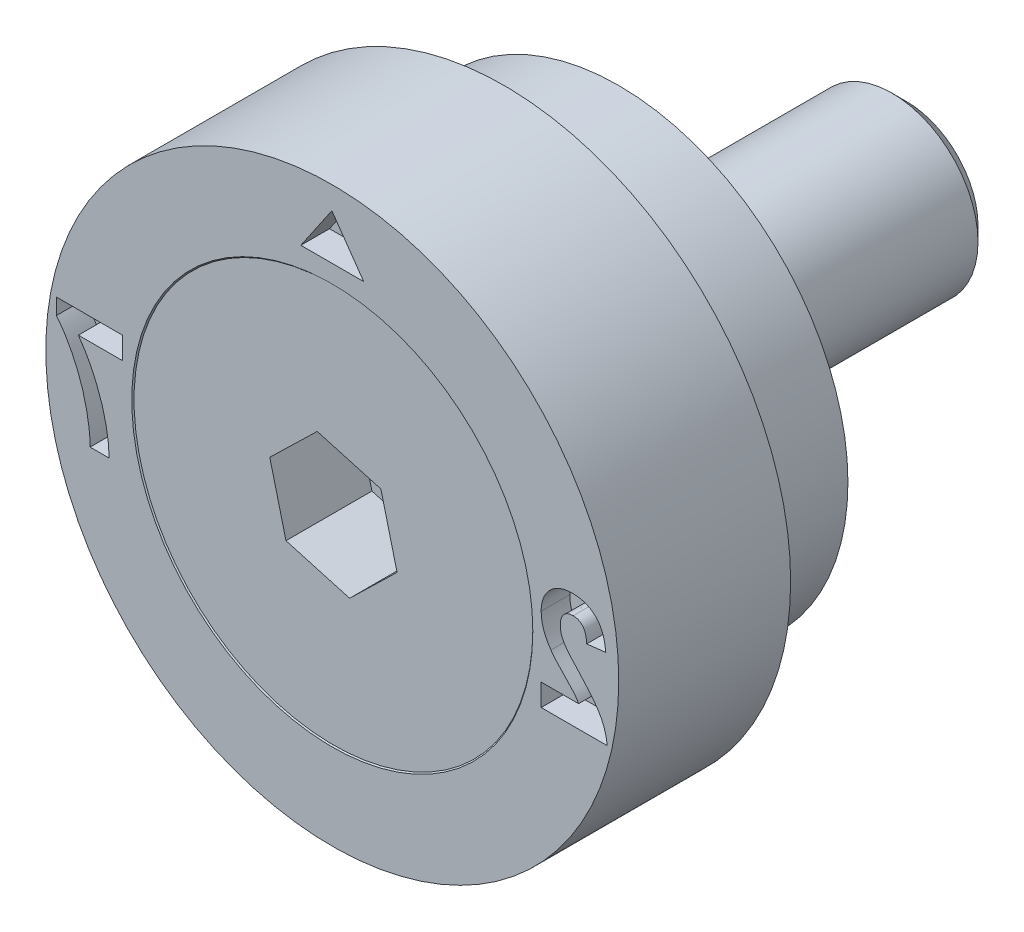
ISO-10303-21;
HEADER;
FILE_DESCRIPTION(('STEP AP214'),'2;1');
FILE_NAME('part.step','',(''),(''),'','','');
FILE_SCHEMA(('AUTOMOTIVE_DESIGN { 1 0 10303 214 1 1 1 1 }'));
ENDSEC;
DATA;
#1=APPLICATION_CONTEXT('core data for automotive mechanical design processes');
#2=APPLICATION_PROTOCOL_DEFINITION('international standard','automotive_design',2000,#1);
#3=PRODUCT_CONTEXT('',#1,'mechanical');
#4=PRODUCT('Part','Part','',(#3));
#5=PRODUCT_RELATED_PRODUCT_CATEGORY('part','',(#4));
#6=PRODUCT_DEFINITION_FORMATION('','',#4);
#7=PRODUCT_DEFINITION_CONTEXT('part definition',#1,'design');
#8=PRODUCT_DEFINITION('design','',#6,#7);
#9=PRODUCT_DEFINITION_SHAPE('','',#8);
#10=(LENGTH_UNIT() NAMED_UNIT(*) SI_UNIT(.MILLI.,.METRE.));
#11=(NAMED_UNIT(*) PLANE_ANGLE_UNIT() SI_UNIT($,.RADIAN.));
#12=(NAMED_UNIT(*) SI_UNIT($,.STERADIAN.) SOLID_ANGLE_UNIT());
#13=UNCERTAINTY_MEASURE_WITH_UNIT(LENGTH_MEASURE(1.E-05),#10,'distance_accuracy_value','');
#14=(GEOMETRIC_REPRESENTATION_CONTEXT(3) GLOBAL_UNCERTAINTY_ASSIGNED_CONTEXT((#13)) GLOBAL_UNIT_ASSIGNED_CONTEXT((#10,
#11,#12)) REPRESENTATION_CONTEXT('',''));
#15=CARTESIAN_POINT('',(0.,0.,0.));
#16=DIRECTION('',(0.,0.,1.));
#17=DIRECTION('',(1.,0.,0.));
#18=AXIS2_PLACEMENT_3D('',#15,#16,#17);
#19=CARTESIAN_POINT('',(0.,0.,-0.0200000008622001));
#20=DIRECTION('',(0.,0.,1.));
#21=DIRECTION('',(1.,0.,0.));
#22=AXIS2_PLACEMENT_3D('',#19,#20,#21);
#23=CYLINDRICAL_SURFACE('',#22,1.5);
#24=CARTESIAN_POINT('',(0.,0.,-2.0000000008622));
#25=DIRECTION('',(0.,0.,1.));
#26=DIRECTION('',(1.,0.,0.));
#27=AXIS2_PLACEMENT_3D('',#24,#25,#26);
#28=CIRCLE('',#27,1.5);
#29=CARTESIAN_POINT('',(1.5,0.,-2.0000000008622));
#30=VERTEX_POINT('',#29);
#31=EDGE_CURVE('E12',#30,#30,#28,.T.);
#32=ORIENTED_EDGE('',*,*,#31,.F.);
#33=EDGE_LOOP('',(#32));
#34=FACE_BOUND('',#33,.T.);
#35=CARTESIAN_POINT('',(0.,0.,-9.7700000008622));
#36=DIRECTION('',(0.,0.,1.));
#37=DIRECTION('',(1.,0.,0.));
#38=AXIS2_PLACEMENT_3D('',#35,#36,#37);
#39=CIRCLE('',#38,1.5);
#40=CARTESIAN_POINT('',(1.5,0.,-9.7700000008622));
#41=VERTEX_POINT('',#40);
#42=EDGE_CURVE('E152',#41,#41,#39,.T.);
#43=ORIENTED_EDGE('',*,*,#42,.T.);
#44=EDGE_LOOP('',(#43));
#45=FACE_BOUND('',#44,.T.);
#46=ADVANCED_FACE('F51',(#34,#45),#23,.T.);
#47=CARTESIAN_POINT('',(0.,0.,-2.0000000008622));
#48=DIRECTION('',(0.,0.,1.));
#49=DIRECTION('',(1.,0.,0.));
#50=AXIS2_PLACEMENT_3D('',#47,#48,#49);
#51=CONICAL_SURFACE('',#50,1.5,0.785398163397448);
#52=CARTESIAN_POINT('',(0.,0.,-0.0200000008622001));
#53=DIRECTION('',(0.,0.,1.));
#54=DIRECTION('',(1.,0.,0.));
#55=AXIS2_PLACEMENT_3D('',#52,#53,#54);
#56=CIRCLE('',#55,3.48);
#57=CARTESIAN_POINT('',(3.48,0.,-0.0200000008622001));
#58=VERTEX_POINT('',#57);
#59=EDGE_CURVE('E58',#58,#58,#56,.T.);
#60=ORIENTED_EDGE('',*,*,#59,.F.);
#61=EDGE_LOOP('',(#60));
#62=FACE_BOUND('',#61,.T.);
#63=ORIENTED_EDGE('',*,*,#31,.T.);
#64=EDGE_LOOP('',(#63));
#65=FACE_BOUND('',#64,.T.);
#66=ADVANCED_FACE('F167',(#62,#65),#51,.T.);
#67=CARTESIAN_POINT('',(0.,3.48,-0.0200000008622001));
#68=DIRECTION('',(0.,0.,-1.));
#69=DIRECTION('',(-1.,0.,0.));
#70=AXIS2_PLACEMENT_3D('',#67,#68,#69);
#71=PLANE('',#70);
#72=DIRECTION('',(0.962144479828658,-0.272539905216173,0.));
#73=VECTOR('',#72,1.);
#74=CARTESIAN_POINT('',(-0.828034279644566,-0.804793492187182,-0.0200000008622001));
#75=LINE('',#74,#73);
#76=CARTESIAN_POINT('',(-0.828034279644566,-0.804793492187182,-0.0200000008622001));
#77=VERTEX_POINT('',#76);
#78=CARTESIAN_POINT('',(0.282954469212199,-1.11949546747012,-0.0200000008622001));
#79=VERTEX_POINT('',#78);
#80=EDGE_CURVE('E139',#77,#79,#75,.T.);
#81=ORIENTED_EDGE('',*,*,#80,.F.);
#82=DIRECTION('',(0.245045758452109,-0.969511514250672,0.));
#83=VECTOR('',#82,1.);
#84=CARTESIAN_POINT('',(-1.11098874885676,0.314701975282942,-0.0200000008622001));
#85=LINE('',#84,#83);
#86=CARTESIAN_POINT('',(-1.11098874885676,0.314701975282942,-0.0200000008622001));
#87=VERTEX_POINT('',#86);
#88=EDGE_CURVE('E65',#87,#77,#85,.T.);
#89=ORIENTED_EDGE('',*,*,#88,.F.);
#90=DIRECTION('',(-0.717098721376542,-0.696971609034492,0.));
#91=VECTOR('',#90,1.);
#92=CARTESIAN_POINT('',(-0.282954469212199,1.11949546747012,-0.0200000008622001));
#93=LINE('',#92,#91);
#94=CARTESIAN_POINT('',(-0.282954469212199,1.11949546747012,-0.0200000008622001));
#95=VERTEX_POINT('',#94);
#96=EDGE_CURVE('E148',#95,#87,#93,.T.);
#97=ORIENTED_EDGE('',*,*,#96,.F.);
#98=DIRECTION('',(-0.962144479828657,0.272539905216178,0.));
#99=VECTOR('',#98,1.);
#100=CARTESIAN_POINT('',(0.828034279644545,0.804793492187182,-0.0200000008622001));
#101=LINE('',#100,#99);
#102=CARTESIAN_POINT('',(0.828034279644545,0.804793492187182,-0.0200000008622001));
#103=VERTEX_POINT('',#102);
#104=EDGE_CURVE('E146',#103,#95,#101,.T.);
#105=ORIENTED_EDGE('',*,*,#104,.F.);
#106=DIRECTION('',(-0.245045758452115,0.96951151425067,0.));
#107=VECTOR('',#106,1.);
#108=CARTESIAN_POINT('',(1.11098874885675,-0.314701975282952,-0.0200000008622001));
#109=LINE('',#108,#107);
#110=CARTESIAN_POINT('',(1.11098874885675,-0.314701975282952,-0.0200000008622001));
#111=VERTEX_POINT('',#110);
#112=EDGE_CURVE('E113',#111,#103,#109,.T.);
#113=ORIENTED_EDGE('',*,*,#112,.F.);
#114=DIRECTION('',(0.717098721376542,0.696971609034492,0.));
#115=VECTOR('',#114,1.);
#116=CARTESIAN_POINT('',(0.282954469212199,-1.11949546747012,-0.0200000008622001));
#117=LINE('',#116,#115);
#118=EDGE_CURVE('E142',#79,#111,#117,.T.);
#119=ORIENTED_EDGE('',*,*,#118,.F.);
#120=EDGE_LOOP('',(#81,#89,#97,#105,#113,#119));
#121=FACE_BOUND('',#120,.T.);
#122=ORIENTED_EDGE('',*,*,#59,.T.);
#123=EDGE_LOOP('',(#122));
#124=FACE_BOUND('',#123,.T.);
#125=ADVANCED_FACE('F165',(#121,#124),#71,.F.);
#126=CARTESIAN_POINT('',(0.,0.,-10.0200000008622));
#127=DIRECTION('',(0.,0.,1.));
#128=DIRECTION('',(1.,0.,0.));
#129=AXIS2_PLACEMENT_3D('',#126,#127,#128);
#130=PLANE('',#129);
#131=CARTESIAN_POINT('',(0.,0.,-10.0200000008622));
#132=DIRECTION('',(0.,0.,1.));
#133=DIRECTION('',(1.,0.,0.));
#134=AXIS2_PLACEMENT_3D('',#131,#132,#133);
#135=CIRCLE('',#134,1.25);
#136=CARTESIAN_POINT('',(1.25,0.,-10.0200000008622));
#137=VERTEX_POINT('',#136);
#138=EDGE_CURVE('E160',#137,#137,#135,.T.);
#139=ORIENTED_EDGE('',*,*,#138,.F.);
#140=EDGE_LOOP('',(#139));
#141=FACE_BOUND('',#140,.T.);
#142=ADVANCED_FACE('F180',(#141),#130,.F.);
#143=CARTESIAN_POINT('',(0.,0.,-10.0200000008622));
#144=DIRECTION('',(0.,0.,1.));
#145=DIRECTION('',(1.,0.,0.));
#146=AXIS2_PLACEMENT_3D('',#143,#144,#145);
#147=CONICAL_SURFACE('',#146,1.25,0.78539816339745);
#148=ORIENTED_EDGE('',*,*,#42,.F.);
#149=EDGE_LOOP('',(#148));
#150=FACE_BOUND('',#149,.T.);
#151=ORIENTED_EDGE('',*,*,#138,.T.);
#152=EDGE_LOOP('',(#151));
#153=FACE_BOUND('',#152,.T.);
#154=ADVANCED_FACE('F176',(#150,#153),#147,.T.);
#155=CARTESIAN_POINT('',(-1.11098874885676,0.314701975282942,-1.5200000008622));
#156=DIRECTION('',(-0.969511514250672,-0.245045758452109,0.));
#157=DIRECTION('',(0.245045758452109,-0.969511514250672,0.));
#158=AXIS2_PLACEMENT_3D('',#155,#156,#157);
#159=PLANE('',#158);
#160=ORIENTED_EDGE('',*,*,#88,.T.);
#161=DIRECTION('',(0.,0.,1.));
#162=VECTOR('',#161,1.);
#163=CARTESIAN_POINT('',(-0.828034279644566,-0.804793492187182,-1.5200000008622));
#164=LINE('',#163,#162);
#165=CARTESIAN_POINT('',(-0.828034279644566,-0.804793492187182,-1.5200000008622));
#166=VERTEX_POINT('',#165);
#167=EDGE_CURVE('E95',#166,#77,#164,.T.);
#168=ORIENTED_EDGE('',*,*,#167,.F.);
#169=DIRECTION('',(0.245045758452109,-0.969511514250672,0.));
#170=VECTOR('',#169,1.);
#171=CARTESIAN_POINT('',(-1.11098874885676,0.314701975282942,-1.5200000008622));
#172=LINE('',#171,#170);
#173=CARTESIAN_POINT('',(-1.11098874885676,0.314701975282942,-1.5200000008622));
#174=VERTEX_POINT('',#173);
#175=EDGE_CURVE('E150',#174,#166,#172,.T.);
#176=ORIENTED_EDGE('',*,*,#175,.F.);
#177=DIRECTION('',(0.,0.,1.));
#178=VECTOR('',#177,1.);
#179=CARTESIAN_POINT('',(-1.11098874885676,0.314701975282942,-1.5200000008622));
#180=LINE('',#179,#178);
#181=EDGE_CURVE('E73',#174,#87,#180,.T.);
#182=ORIENTED_EDGE('',*,*,#181,.T.);
#183=EDGE_LOOP('',(#160,#168,#176,#182));
#184=FACE_BOUND('',#183,.T.);
#185=ADVANCED_FACE('F179',(#184),#159,.F.);
#186=CARTESIAN_POINT('',(-0.282954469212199,1.11949546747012,-1.5200000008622));
#187=DIRECTION('',(-0.696971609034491,0.717098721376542,0.));
#188=DIRECTION('',(-0.717098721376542,-0.696971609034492,0.));
#189=AXIS2_PLACEMENT_3D('',#186,#187,#188);
#190=PLANE('',#189);
#191=ORIENTED_EDGE('',*,*,#96,.T.);
#192=ORIENTED_EDGE('',*,*,#181,.F.);
#193=DIRECTION('',(-0.717098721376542,-0.696971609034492,0.));
#194=VECTOR('',#193,1.);
#195=CARTESIAN_POINT('',(-0.282954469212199,1.11949546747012,-1.5200000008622));
#196=LINE('',#195,#194);
#197=CARTESIAN_POINT('',(-0.282954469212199,1.11949546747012,-1.5200000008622));
#198=VERTEX_POINT('',#197);
#199=EDGE_CURVE('E125',#198,#174,#196,.T.);
#200=ORIENTED_EDGE('',*,*,#199,.F.);
#201=DIRECTION('',(0.,0.,1.));
#202=VECTOR('',#201,1.);
#203=CARTESIAN_POINT('',(-0.282954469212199,1.11949546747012,-1.5200000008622));
#204=LINE('',#203,#202);
#205=EDGE_CURVE('E117',#198,#95,#204,.T.);
#206=ORIENTED_EDGE('',*,*,#205,.T.);
#207=EDGE_LOOP('',(#191,#192,#200,#206));
#208=FACE_BOUND('',#207,.T.);
#209=ADVANCED_FACE('F194',(#208),#190,.F.);
#210=CARTESIAN_POINT('',(0.828034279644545,0.804793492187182,-1.5200000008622));
#211=DIRECTION('',(0.272539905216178,0.962144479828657,0.));
#212=DIRECTION('',(-0.962144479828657,0.272539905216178,0.));
#213=AXIS2_PLACEMENT_3D('',#210,#211,#212);
#214=PLANE('',#213);
#215=ORIENTED_EDGE('',*,*,#104,.T.);
#216=ORIENTED_EDGE('',*,*,#205,.F.);
#217=DIRECTION('',(-0.962144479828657,0.272539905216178,0.));
#218=VECTOR('',#217,1.);
#219=CARTESIAN_POINT('',(0.828034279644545,0.804793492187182,-1.5200000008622));
#220=LINE('',#219,#218);
#221=CARTESIAN_POINT('',(0.828034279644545,0.804793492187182,-1.5200000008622));
#222=VERTEX_POINT('',#221);
#223=EDGE_CURVE('E121',#222,#198,#220,.T.);
#224=ORIENTED_EDGE('',*,*,#223,.F.);
#225=DIRECTION('',(0.,0.,1.));
#226=VECTOR('',#225,1.);
#227=CARTESIAN_POINT('',(0.828034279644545,0.804793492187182,-1.5200000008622));
#228=LINE('',#227,#226);
#229=EDGE_CURVE('E106',#222,#103,#228,.T.);
#230=ORIENTED_EDGE('',*,*,#229,.T.);
#231=EDGE_LOOP('',(#215,#216,#224,#230));
#232=FACE_BOUND('',#231,.T.);
#233=ADVANCED_FACE('F122',(#232),#214,.F.);
#234=CARTESIAN_POINT('',(1.11098874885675,-0.314701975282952,-1.5200000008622));
#235=DIRECTION('',(0.96951151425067,0.245045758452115,0.));
#236=DIRECTION('',(-0.245045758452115,0.96951151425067,0.));
#237=AXIS2_PLACEMENT_3D('',#234,#235,#236);
#238=PLANE('',#237);
#239=ORIENTED_EDGE('',*,*,#112,.T.);
#240=ORIENTED_EDGE('',*,*,#229,.F.);
#241=DIRECTION('',(-0.245045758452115,0.96951151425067,0.));
#242=VECTOR('',#241,1.);
#243=CARTESIAN_POINT('',(1.11098874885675,-0.314701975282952,-1.5200000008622));
#244=LINE('',#243,#242);
#245=CARTESIAN_POINT('',(1.11098874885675,-0.314701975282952,-1.5200000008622));
#246=VERTEX_POINT('',#245);
#247=EDGE_CURVE('E110',#246,#222,#244,.T.);
#248=ORIENTED_EDGE('',*,*,#247,.F.);
#249=DIRECTION('',(0.,0.,1.));
#250=VECTOR('',#249,1.);
#251=CARTESIAN_POINT('',(1.11098874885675,-0.314701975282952,-1.5200000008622));
#252=LINE('',#251,#250);
#253=EDGE_CURVE('E118',#246,#111,#252,.T.);
#254=ORIENTED_EDGE('',*,*,#253,.T.);
#255=EDGE_LOOP('',(#239,#240,#248,#254));
#256=FACE_BOUND('',#255,.T.);
#257=ADVANCED_FACE('F108',(#256),#238,.F.);
#258=CARTESIAN_POINT('',(0.282954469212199,-1.11949546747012,-1.5200000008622));
#259=DIRECTION('',(0.696971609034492,-0.717098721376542,0.));
#260=DIRECTION('',(0.717098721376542,0.696971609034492,0.));
#261=AXIS2_PLACEMENT_3D('',#258,#259,#260);
#262=PLANE('',#261);
#263=ORIENTED_EDGE('',*,*,#118,.T.);
#264=ORIENTED_EDGE('',*,*,#253,.F.);
#265=DIRECTION('',(0.717098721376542,0.696971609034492,0.));
#266=VECTOR('',#265,1.);
#267=CARTESIAN_POINT('',(0.282954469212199,-1.11949546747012,-1.5200000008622));
#268=LINE('',#267,#266);
#269=CARTESIAN_POINT('',(0.282954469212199,-1.11949546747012,-1.5200000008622));
#270=VERTEX_POINT('',#269);
#271=EDGE_CURVE('E131',#270,#246,#268,.T.);
#272=ORIENTED_EDGE('',*,*,#271,.F.);
#273=DIRECTION('',(0.,0.,1.));
#274=VECTOR('',#273,1.);
#275=CARTESIAN_POINT('',(0.282954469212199,-1.11949546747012,-1.5200000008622));
#276=LINE('',#275,#274);
#277=EDGE_CURVE('E155',#270,#79,#276,.T.);
#278=ORIENTED_EDGE('',*,*,#277,.T.);
#279=EDGE_LOOP('',(#263,#264,#272,#278));
#280=FACE_BOUND('',#279,.T.);
#281=ADVANCED_FACE('F198',(#280),#262,.F.);
#282=CARTESIAN_POINT('',(-0.828034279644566,-0.804793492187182,-1.5200000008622));
#283=DIRECTION('',(-0.272539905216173,-0.962144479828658,0.));
#284=DIRECTION('',(0.962144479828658,-0.272539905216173,0.));
#285=AXIS2_PLACEMENT_3D('',#282,#283,#284);
#286=PLANE('',#285);
#287=ORIENTED_EDGE('',*,*,#80,.T.);
#288=ORIENTED_EDGE('',*,*,#277,.F.);
#289=DIRECTION('',(0.962144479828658,-0.272539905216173,0.));
#290=VECTOR('',#289,1.);
#291=CARTESIAN_POINT('',(-0.828034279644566,-0.804793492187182,-1.5200000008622));
#292=LINE('',#291,#290);
#293=EDGE_CURVE('E133',#166,#270,#292,.T.);
#294=ORIENTED_EDGE('',*,*,#293,.F.);
#295=ORIENTED_EDGE('',*,*,#167,.T.);
#296=EDGE_LOOP('',(#287,#288,#294,#295));
#297=FACE_BOUND('',#296,.T.);
#298=ADVANCED_FACE('F195',(#297),#286,.F.);
#299=CARTESIAN_POINT('',(0.,0.,-1.5200000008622));
#300=DIRECTION('',(0.,0.,1.));
#301=DIRECTION('',(1.,0.,0.));
#302=AXIS2_PLACEMENT_3D('',#299,#300,#301);
#303=PLANE('',#302);
#304=ORIENTED_EDGE('',*,*,#175,.T.);
#305=ORIENTED_EDGE('',*,*,#293,.T.);
#306=ORIENTED_EDGE('',*,*,#271,.T.);
#307=ORIENTED_EDGE('',*,*,#247,.T.);
#308=ORIENTED_EDGE('',*,*,#223,.T.);
#309=ORIENTED_EDGE('',*,*,#199,.T.);
#310=EDGE_LOOP('',(#304,#305,#306,#307,#308,#309));
#311=FACE_BOUND('',#310,.T.);
#312=ADVANCED_FACE('F128',(#311),#303,.T.);
#313=CLOSED_SHELL('',(#46,#66,#125,#142,#154,#185,#209,#233,#257,#281,#298,#312));
#314=MANIFOLD_SOLID_BREP('B2',#313);
#315=CARTESIAN_POINT('',(0.,0.,3.12219627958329));
#316=DIRECTION('',(0.,0.,1.));
#317=DIRECTION('',(1.,0.,0.));
#318=AXIS2_PLACEMENT_3D('',#315,#316,#317);
#319=CYLINDRICAL_SURFACE('',#318,5.);
#320=CARTESIAN_POINT('',(0.,0.,0.));
#321=DIRECTION('',(0.,0.,1.));
#322=DIRECTION('',(1.,0.,0.));
#323=AXIS2_PLACEMENT_3D('',#320,#321,#322);
#324=CIRCLE('',#323,5.);
#325=CARTESIAN_POINT('',(5.,0.,0.));
#326=VERTEX_POINT('',#325);
#327=EDGE_CURVE('E49',#326,#326,#324,.T.);
#328=ORIENTED_EDGE('',*,*,#327,.F.);
#329=EDGE_LOOP('',(#328));
#330=FACE_BOUND('',#329,.T.);
#331=CARTESIAN_POINT('',(0.,0.,-3.));
#332=DIRECTION('',(0.,0.,1.));
#333=DIRECTION('',(1.,0.,0.));
#334=AXIS2_PLACEMENT_3D('',#331,#332,#333);
#335=CIRCLE('',#334,5.);
#336=CARTESIAN_POINT('',(5.,0.,-3.));
#337=VERTEX_POINT('',#336);
#338=EDGE_CURVE('E613',#337,#337,#335,.T.);
#339=ORIENTED_EDGE('',*,*,#338,.T.);
#340=EDGE_LOOP('',(#339));
#341=FACE_BOUND('',#340,.T.);
#342=ADVANCED_FACE('F310',(#330,#341),#319,.T.);
#343=CARTESIAN_POINT('',(0.,5.,0.));
#344=DIRECTION('',(0.,0.,-1.));
#345=DIRECTION('',(-1.,0.,0.));
#346=AXIS2_PLACEMENT_3D('',#343,#344,#345);
#347=PLANE('',#346);
#348=DIRECTION('',(0.,-1.,0.));
#349=VECTOR('',#348,1.);
#350=CARTESIAN_POINT('',(3.64578974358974,-0.694884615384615,0.));
#351=LINE('',#350,#349);
#352=CARTESIAN_POINT('',(3.64578974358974,-0.694884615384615,0.));
#353=VERTEX_POINT('',#352);
#354=CARTESIAN_POINT('',(3.64578974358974,-1.0795,0.));
#355=VERTEX_POINT('',#354);
#356=EDGE_CURVE('E822',#353,#355,#351,.T.);
#357=ORIENTED_EDGE('',*,*,#356,.F.);
#358=DIRECTION('',(-1.,0.,0.));
#359=VECTOR('',#358,1.);
#360=CARTESIAN_POINT('',(4.29923525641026,-0.694884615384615,0.));
#361=LINE('',#360,#359);
#362=CARTESIAN_POINT('',(4.29923525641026,-0.694884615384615,0.));
#363=VERTEX_POINT('',#362);
#364=EDGE_CURVE('E324',#363,#353,#361,.T.);
#365=ORIENTED_EDGE('',*,*,#364,.F.);
#366=CARTESIAN_POINT('',(3.81566153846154,-0.125173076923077,0.));
#367=CARTESIAN_POINT('',(3.82091886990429,-0.132847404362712,0.));
#368=CARTESIAN_POINT('',(3.83220192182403,-0.149317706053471,0.));
#369=CARTESIAN_POINT('',(3.85205715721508,-0.17421227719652,0.));
#370=CARTESIAN_POINT('',(3.8744361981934,-0.202014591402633,0.));
#371=CARTESIAN_POINT('',(3.90014076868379,-0.232028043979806,0.));
#372=CARTESIAN_POINT('',(3.92905633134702,-0.264301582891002,0.));
#373=CARTESIAN_POINT('',(3.96053053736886,-0.299443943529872,0.));
#374=CARTESIAN_POINT('',(3.99616295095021,-0.33596917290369,0.));
#375=CARTESIAN_POINT('',(4.03290284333,-0.374801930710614,0.));
#376=CARTESIAN_POINT('',(4.07025825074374,-0.412253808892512,0.));
#377=CARTESIAN_POINT('',(4.1041164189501,-0.448096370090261,0.));
#378=CARTESIAN_POINT('',(4.13475565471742,-0.480101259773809,0.));
#379=CARTESIAN_POINT('',(4.16148576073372,-0.508922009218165,0.));
#380=CARTESIAN_POINT('',(4.18469884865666,-0.534183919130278,0.));
#381=CARTESIAN_POINT('',(4.20450316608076,-0.555682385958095,0.));
#382=CARTESIAN_POINT('',(4.22021600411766,-0.574175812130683,0.));
#383=CARTESIAN_POINT('',(4.24238770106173,-0.602402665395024,0.));
#384=CARTESIAN_POINT('',(4.27029425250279,-0.641165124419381,0.));
#385=CARTESIAN_POINT('',(4.28983877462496,-0.677443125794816,0.));
#386=CARTESIAN_POINT('',(4.29923525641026,-0.694884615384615,0.));
#387=B_SPLINE_CURVE_WITH_KNOTS('',3,(#366,#367,#368,#369,#370,#371,#372,#373,#374,#375,#376,
#377,#378,#379,#380,#381,#382,#383,#384,#385,#386),.UNSPECIFIED.,.F.,.F.,(4,1,1,1,1,1,1,1,1,1,1,
1,1,1,1,1,1,1,4),(0.,0.0372293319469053,0.079899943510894,0.127410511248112,0.180123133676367,
0.238064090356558,0.30089248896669,0.368957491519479,0.442313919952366,0.514902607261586,
0.580699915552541,0.639694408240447,0.692276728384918,0.73805927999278,0.777043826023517,
0.809286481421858,0.835170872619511,0.920754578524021,1.),.UNSPECIFIED.);
#388=CARTESIAN_POINT('',(3.81566153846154,-0.125173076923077,0.));
#389=VERTEX_POINT('',#388);
#390=EDGE_CURVE('E485',#389,#363,#387,.T.);
#391=ORIENTED_EDGE('',*,*,#390,.F.);
#392=CARTESIAN_POINT('',(3.64578974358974,0.376429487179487,0.));
#393=CARTESIAN_POINT('',(3.64621245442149,0.354638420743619,0.));
#394=CARTESIAN_POINT('',(3.64705015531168,0.311454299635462,0.));
#395=CARTESIAN_POINT('',(3.65494215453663,0.247527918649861,0.));
#396=CARTESIAN_POINT('',(3.66766685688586,0.185179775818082,0.));
#397=CARTESIAN_POINT('',(3.68609868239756,0.124042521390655,0.));
#398=CARTESIAN_POINT('',(3.70952430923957,0.0629087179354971,0.));
#399=CARTESIAN_POINT('',(3.7391619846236,0.00107661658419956,0.));
#400=CARTESIAN_POINT('',(3.77429810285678,-0.0623403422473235,0.));
#401=CARTESIAN_POINT('',(3.80162214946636,-0.103846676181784,0.));
#402=CARTESIAN_POINT('',(3.81566153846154,-0.125173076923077,0.));
#403=B_SPLINE_CURVE_WITH_KNOTS('',3,(#392,#393,#394,#395,#396,#397,#398,#399,#400,#401,#402),
.UNSPECIFIED.,.F.,.F.,(4,1,1,1,1,1,1,1,4),(0.,0.121430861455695,0.240643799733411,
0.358470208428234,0.475770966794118,0.596193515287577,0.723070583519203,0.85771068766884,1.),.UNSPECIFIED.);
#404=CARTESIAN_POINT('',(3.64578974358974,0.376429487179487,0.));
#405=VERTEX_POINT('',#404);
#406=EDGE_CURVE('E488',#405,#389,#403,.T.);
#407=ORIENTED_EDGE('',*,*,#406,.F.);
#408=CARTESIAN_POINT('',(4.19667115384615,0.9205,0.));
#409=CARTESIAN_POINT('',(4.17581907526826,0.920051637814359,0.));
#410=CARTESIAN_POINT('',(4.13518578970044,0.919177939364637,0.));
#411=CARTESIAN_POINT('',(4.07584387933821,0.911992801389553,0.));
#412=CARTESIAN_POINT('',(4.02003299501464,0.899340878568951,0.));
#413=CARTESIAN_POINT('',(3.96726601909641,0.882960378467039,0.));
#414=CARTESIAN_POINT('',(3.91839562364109,0.860482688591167,0.));
#415=CARTESIAN_POINT('',(3.87268241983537,0.833610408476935,0.));
#416=CARTESIAN_POINT('',(3.8306551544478,0.8013846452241,0.));
#417=CARTESIAN_POINT('',(3.7921920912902,0.76491912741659,0.));
#418=CARTESIAN_POINT('',(3.75792408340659,0.724880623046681,0.));
#419=CARTESIAN_POINT('',(3.72764558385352,0.682365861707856,0.));
#420=CARTESIAN_POINT('',(3.70225492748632,0.637244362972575,0.));
#421=CARTESIAN_POINT('',(3.68180020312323,0.589637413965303,0.));
#422=CARTESIAN_POINT('',(3.66574316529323,0.53972788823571,0.));
#423=CARTESIAN_POINT('',(3.65406868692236,0.48745142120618,0.));
#424=CARTESIAN_POINT('',(3.64722057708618,0.432701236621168,0.));
#425=CARTESIAN_POINT('',(3.64627242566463,0.395412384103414,0.));
#426=CARTESIAN_POINT('',(3.64578974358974,0.376429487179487,0.));
#427=B_SPLINE_CURVE_WITH_KNOTS('',3,(#408,#409,#410,#411,#412,#413,#414,#415,#416,#417,#418,
#419,#420,#421,#422,#423,#424,#425,#426),.UNSPECIFIED.,.F.,.F.,(4,1,1,1,1,1,1,1,1,1,1,1,1,1,1,1,
4),(0.,0.0718026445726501,0.139917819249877,0.205419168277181,0.268691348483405,
0.329822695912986,0.390243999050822,0.450956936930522,0.511795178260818,0.572457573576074,
0.632179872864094,0.69128264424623,0.750406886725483,0.810332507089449,0.871593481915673,
0.934631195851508,1.),.UNSPECIFIED.);
#428=CARTESIAN_POINT('',(4.19667115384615,0.9205,0.));
#429=VERTEX_POINT('',#428);
#430=EDGE_CURVE('E757',#429,#405,#427,.T.);
#431=ORIENTED_EDGE('',*,*,#430,.F.);
#432=CARTESIAN_POINT('',(4.77399487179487,0.317134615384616,0.));
#433=CARTESIAN_POINT('',(4.77131775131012,0.343098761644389,0.));
#434=CARTESIAN_POINT('',(4.76613036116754,0.393408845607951,0.));
#435=CARTESIAN_POINT('',(4.75213725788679,0.465592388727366,0.));
#436=CARTESIAN_POINT('',(4.73533746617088,0.532301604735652,0.));
#437=CARTESIAN_POINT('',(4.7139375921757,0.593271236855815,0.));
#438=CARTESIAN_POINT('',(4.68897145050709,0.648742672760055,0.));
#439=CARTESIAN_POINT('',(4.65961943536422,0.698290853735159,0.));
#440=CARTESIAN_POINT('',(4.62648435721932,0.742308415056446,0.));
#441=CARTESIAN_POINT('',(4.58907375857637,0.780409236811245,0.));
#442=CARTESIAN_POINT('',(4.54814862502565,0.813171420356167,0.));
#443=CARTESIAN_POINT('',(4.5053864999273,0.842328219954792,0.));
#444=CARTESIAN_POINT('',(4.45974864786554,0.866424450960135,0.));
#445=CARTESIAN_POINT('',(4.41177480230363,0.885993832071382,0.));
#446=CARTESIAN_POINT('',(4.36161481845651,0.901930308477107,0.));
#447=CARTESIAN_POINT('',(4.30865203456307,0.912378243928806,0.));
#448=CARTESIAN_POINT('',(4.253495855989,0.919617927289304,0.));
#449=CARTESIAN_POINT('',(4.21579287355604,0.920203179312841,0.));
#450=CARTESIAN_POINT('',(4.19667115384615,0.9205,0.));
#451=B_SPLINE_CURVE_WITH_KNOTS('',3,(#432,#433,#434,#435,#436,#437,#438,#439,#440,#441,#442,
#443,#444,#445,#446,#447,#448,#449,#450),.UNSPECIFIED.,.F.,.F.,(4,1,1,1,1,1,1,1,1,1,1,1,1,1,1,1,
4),(0.,0.0836347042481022,0.16205689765,0.235468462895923,0.303979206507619,0.368923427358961,
0.430156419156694,0.488208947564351,0.545123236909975,0.60081849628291,0.65603122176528,
0.710804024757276,0.765898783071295,0.821956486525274,0.879217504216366,0.938743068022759,1.),.UNSPECIFIED.);
#452=CARTESIAN_POINT('',(4.77399487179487,0.317134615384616,0.));
#453=VERTEX_POINT('',#452);
#454=EDGE_CURVE('E765',#453,#429,#451,.T.);
#455=ORIENTED_EDGE('',*,*,#454,.F.);
#456=DIRECTION('',(0.993678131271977,0.112266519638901,0.));
#457=VECTOR('',#456,1.);
#458=CARTESIAN_POINT('',(4.44066153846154,0.279474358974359,0.));
#459=LINE('',#458,#457);
#460=CARTESIAN_POINT('',(4.44066153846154,0.279474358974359,0.));
#461=VERTEX_POINT('',#460);
#462=EDGE_CURVE('E773',#461,#453,#459,.T.);
#463=ORIENTED_EDGE('',*,*,#462,.F.);
#464=CARTESIAN_POINT('',(4.20388269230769,0.587166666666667,0.));
#465=CARTESIAN_POINT('',(4.22040159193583,0.586388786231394,0.));
#466=CARTESIAN_POINT('',(4.25228264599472,0.584887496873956,0.));
#467=CARTESIAN_POINT('',(4.29762478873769,0.571328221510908,0.));
#468=CARTESIAN_POINT('',(4.33735542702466,0.548245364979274,0.));
#469=CARTESIAN_POINT('',(4.36575604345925,0.522033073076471,0.));
#470=CARTESIAN_POINT('',(4.3848646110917,0.496493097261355,0.));
#471=CARTESIAN_POINT('',(4.3976765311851,0.474079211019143,0.));
#472=CARTESIAN_POINT('',(4.40934463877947,0.448970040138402,0.));
#473=CARTESIAN_POINT('',(4.41877140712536,0.420683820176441,0.));
#474=CARTESIAN_POINT('',(4.42683056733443,0.389634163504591,0.));
#475=CARTESIAN_POINT('',(4.43308114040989,0.355614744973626,0.));
#476=CARTESIAN_POINT('',(4.43795310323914,0.318574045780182,0.));
#477=CARTESIAN_POINT('',(4.43973552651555,0.292842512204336,0.));
#478=CARTESIAN_POINT('',(4.44066153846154,0.279474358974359,0.));
#479=B_SPLINE_CURVE_WITH_KNOTS('',3,(#464,#465,#466,#467,#468,#469,#470,#471,#472,#473,#474,
#475,#476,#477,#478),.UNSPECIFIED.,.F.,.F.,(4,1,1,1,1,1,1,1,1,1,1,1,4),(0.,0.113180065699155,
0.218434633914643,0.321087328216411,0.426146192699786,0.481136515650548,0.539455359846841,
0.603018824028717,0.670840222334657,0.743752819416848,0.823023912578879,0.908056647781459,1.),.UNSPECIFIED.);
#480=CARTESIAN_POINT('',(4.20388269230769,0.587166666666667,0.));
#481=VERTEX_POINT('',#480);
#482=EDGE_CURVE('E779',#481,#461,#479,.T.);
#483=ORIENTED_EDGE('',*,*,#482,.F.);
#484=CARTESIAN_POINT('',(3.97912307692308,0.324746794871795,0.));
#485=CARTESIAN_POINT('',(3.97969358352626,0.344703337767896,0.));
#486=CARTESIAN_POINT('',(3.98077233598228,0.382438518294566,0.));
#487=CARTESIAN_POINT('',(3.99200245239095,0.435521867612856,0.));
#488=CARTESIAN_POINT('',(4.01087480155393,0.481294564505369,0.));
#489=CARTESIAN_POINT('',(4.03708472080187,0.519910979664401,0.));
#490=CARTESIAN_POINT('',(4.07067009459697,0.54980786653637,0.));
#491=CARTESIAN_POINT('',(4.10967671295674,0.572501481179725,0.));
#492=CARTESIAN_POINT('',(4.1552446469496,0.584615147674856,0.));
#493=CARTESIAN_POINT('',(4.1872587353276,0.586294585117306,0.));
#494=CARTESIAN_POINT('',(4.20388269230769,0.587166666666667,0.));
#495=B_SPLINE_CURVE_WITH_KNOTS('',3,(#484,#485,#486,#487,#488,#489,#490,#491,#492,#493,#494),
.UNSPECIFIED.,.F.,.F.,(4,1,1,1,1,1,1,1,4),(0.,0.152713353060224,0.288760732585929,
0.413023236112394,0.52994305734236,0.642943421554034,0.754737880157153,0.872642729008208,1.),.UNSPECIFIED.);
#496=CARTESIAN_POINT('',(3.97912307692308,0.324746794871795,0.));
#497=VERTEX_POINT('',#496);
#498=EDGE_CURVE('E784',#497,#481,#495,.T.);
#499=ORIENTED_EDGE('',*,*,#498,.F.);
#500=CARTESIAN_POINT('',(4.04683141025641,0.0935769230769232,0.));
#501=CARTESIAN_POINT('',(4.03647064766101,0.112850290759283,0.));
#502=CARTESIAN_POINT('',(4.01639721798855,0.150191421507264,0.));
#503=CARTESIAN_POINT('',(3.99488777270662,0.208579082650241,0.));
#504=CARTESIAN_POINT('',(3.98195765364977,0.266752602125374,0.));
#505=CARTESIAN_POINT('',(3.98005949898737,0.30558801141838,0.));
#506=CARTESIAN_POINT('',(3.97912307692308,0.324746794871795,0.));
#507=B_SPLINE_CURVE_WITH_KNOTS('',3,(#500,#501,#502,#503,#504,#505,#506),.UNSPECIFIED.,.F.,.F.,
(4,1,1,1,4),(0.,0.269282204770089,0.52172003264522,0.764048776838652,1.),.UNSPECIFIED.);
#508=CARTESIAN_POINT('',(4.04683141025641,0.0935769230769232,0.));
#509=VERTEX_POINT('',#508);
#510=EDGE_CURVE('E792',#509,#497,#507,.T.);
#511=ORIENTED_EDGE('',*,*,#510,.F.);
#512=CARTESIAN_POINT('',(4.31886666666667,-0.229339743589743,0.));
#513=CARTESIAN_POINT('',(4.3012107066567,-0.210268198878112,0.));
#514=CARTESIAN_POINT('',(4.2676263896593,-0.173991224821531,0.));
#515=CARTESIAN_POINT('',(4.22007436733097,-0.121763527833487,0.));
#516=CARTESIAN_POINT('',(4.1780980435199,-0.0741321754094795,0.));
#517=CARTESIAN_POINT('',(4.14131111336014,-0.0314438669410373,0.));
#518=CARTESIAN_POINT('',(4.10976600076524,0.00636764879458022,0.));
#519=CARTESIAN_POINT('',(4.08375243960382,0.0394290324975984,0.));
#520=CARTESIAN_POINT('',(4.06304816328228,0.0678334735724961,0.));
#521=CARTESIAN_POINT('',(4.05182784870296,0.0856452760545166,0.));
#522=CARTESIAN_POINT('',(4.04683141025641,0.0935769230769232,0.));
#523=B_SPLINE_CURVE_WITH_KNOTS('',3,(#512,#513,#514,#515,#516,#517,#518,#519,#520,#521,#522),
.UNSPECIFIED.,.F.,.F.,(4,1,1,1,1,1,1,1,4),(0.,0.184436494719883,0.350826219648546,
0.50123098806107,0.634967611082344,0.750729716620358,0.850641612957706,0.933490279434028,1.),.UNSPECIFIED.);
#524=CARTESIAN_POINT('',(4.31886666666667,-0.229339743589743,0.));
#525=VERTEX_POINT('',#524);
#526=EDGE_CURVE('E800',#525,#509,#523,.T.);
#527=ORIENTED_EDGE('',*,*,#526,.F.);
#528=CARTESIAN_POINT('',(4.7996358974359,-1.0795,0.));
#529=CARTESIAN_POINT('',(4.79566653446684,-1.04665730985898,0.));
#530=CARTESIAN_POINT('',(4.78774886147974,-0.981146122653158,0.));
#531=CARTESIAN_POINT('',(4.76328976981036,-0.88523602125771,0.));
#532=CARTESIAN_POINT('',(4.73095650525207,-0.791575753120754,0.));
#533=CARTESIAN_POINT('',(4.69540984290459,-0.715449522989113,0.));
#534=CARTESIAN_POINT('',(4.66088844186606,-0.653533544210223,0.));
#535=CARTESIAN_POINT('',(4.62854439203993,-0.60362757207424,0.));
#536=CARTESIAN_POINT('',(4.59081496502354,-0.549939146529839,0.));
#537=CARTESIAN_POINT('',(4.54742576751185,-0.49268902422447,0.));
#538=CARTESIAN_POINT('',(4.49847546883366,-0.431813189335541,0.));
#539=CARTESIAN_POINT('',(4.44388626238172,-0.367368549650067,0.));
#540=CARTESIAN_POINT('',(4.38379499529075,-0.299105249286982,0.));
#541=CARTESIAN_POINT('',(4.34101685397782,-0.253140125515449,0.));
#542=CARTESIAN_POINT('',(4.31886666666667,-0.229339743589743,0.));
#543=B_SPLINE_CURVE_WITH_KNOTS('',3,(#528,#529,#530,#531,#532,#533,#534,#535,#536,#537,#538,
#539,#540,#541,#542),.UNSPECIFIED.,.F.,.F.,(4,1,1,1,1,1,1,1,1,1,1,1,4),(0.,0.0994452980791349,
0.198363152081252,0.297103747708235,0.397237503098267,0.450667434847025,0.510300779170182,
0.576071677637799,0.648078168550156,0.72639487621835,0.811079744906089,0.902178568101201,1.),.UNSPECIFIED.);
#544=CARTESIAN_POINT('',(4.7996358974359,-1.0795,0.));
#545=VERTEX_POINT('',#544);
#546=EDGE_CURVE('E808',#545,#525,#543,.T.);
#547=ORIENTED_EDGE('',*,*,#546,.F.);
#548=DIRECTION('',(1.,0.,0.));
#549=VECTOR('',#548,1.);
#550=CARTESIAN_POINT('',(3.64578974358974,-1.0795,0.));
#551=LINE('',#550,#549);
#552=EDGE_CURVE('E816',#355,#545,#551,.T.);
#553=ORIENTED_EDGE('',*,*,#552,.F.);
#554=EDGE_LOOP('',(#357,#365,#391,#407,#431,#455,#463,#483,#499,#511,#527,#547,#553));
#555=FACE_BOUND('',#554,.T.);
#556=DIRECTION('',(0.,1.,0.));
#557=VECTOR('',#556,1.);
#558=CARTESIAN_POINT('',(-3.66292820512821,0.51024358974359,0.));
#559=LINE('',#558,#557);
#560=CARTESIAN_POINT('',(-3.66292820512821,0.51024358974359,0.));
#561=VERTEX_POINT('',#560);
#562=CARTESIAN_POINT('',(-3.66292820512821,0.894858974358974,0.));
#563=VERTEX_POINT('',#562);
#564=EDGE_CURVE('E550',#561,#563,#559,.T.);
#565=ORIENTED_EDGE('',*,*,#564,.F.);
#566=DIRECTION('',(1.,0.,0.));
#567=VECTOR('',#566,1.);
#568=CARTESIAN_POINT('',(-4.43175833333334,0.51024358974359,0.));
#569=LINE('',#568,#567);
#570=CARTESIAN_POINT('',(-4.43175833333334,0.51024358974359,0.));
#571=VERTEX_POINT('',#570);
#572=EDGE_CURVE('E332',#571,#561,#569,.T.);
#573=ORIENTED_EDGE('',*,*,#572,.F.);
#574=CARTESIAN_POINT('',(-3.89369743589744,-1.0795,0.));
#575=CARTESIAN_POINT('',(-3.89488760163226,-1.04542999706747,0.));
#576=CARTESIAN_POINT('',(-3.89728014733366,-0.976940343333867,0.));
#577=CARTESIAN_POINT('',(-3.90596599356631,-0.874179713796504,0.));
#578=CARTESIAN_POINT('',(-3.91814526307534,-0.770798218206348,0.));
#579=CARTESIAN_POINT('',(-3.93564578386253,-0.667159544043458,0.));
#580=CARTESIAN_POINT('',(-3.95693570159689,-0.562810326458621,0.));
#581=CARTESIAN_POINT('',(-3.98200165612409,-0.457955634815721,0.));
#582=CARTESIAN_POINT('',(-4.01186727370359,-0.352698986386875,0.));
#583=CARTESIAN_POINT('',(-4.0457370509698,-0.247553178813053,0.));
#584=CARTESIAN_POINT('',(-4.08327846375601,-0.143509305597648,0.));
#585=CARTESIAN_POINT('',(-4.12365239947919,-0.0415867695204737,0.));
#586=CARTESIAN_POINT('',(-4.16733754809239,0.0574523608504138,0.));
#587=CARTESIAN_POINT('',(-4.21428176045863,0.153586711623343,0.));
#588=CARTESIAN_POINT('',(-4.26396040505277,0.247013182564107,0.));
#589=CARTESIAN_POINT('',(-4.31647421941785,0.337699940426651,0.));
#590=CARTESIAN_POINT('',(-4.37202233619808,0.425650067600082,0.));
#591=CARTESIAN_POINT('',(-4.41188252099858,0.482096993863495,0.));
#592=CARTESIAN_POINT('',(-4.43175833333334,0.51024358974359,0.));
#593=B_SPLINE_CURVE_WITH_KNOTS('',3,(#574,#575,#576,#577,#578,#579,#580,#581,#582,#583,#584,
#585,#586,#587,#588,#589,#590,#591,#592),.UNSPECIFIED.,.F.,.F.,(4,1,1,1,1,1,1,1,1,1,1,1,1,1,1,1,
4),(0.,0.0600673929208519,0.120751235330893,0.181671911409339,0.24345918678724,
0.305905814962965,0.369322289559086,0.433393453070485,0.498664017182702,0.563949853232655,
0.628278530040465,0.691815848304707,0.754651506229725,0.816767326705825,0.878243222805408,
0.939287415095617,1.),.UNSPECIFIED.);
#594=CARTESIAN_POINT('',(-3.89369743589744,-1.0795,0.));
#595=VERTEX_POINT('',#594);
#596=EDGE_CURVE('E570',#595,#571,#593,.T.);
#597=ORIENTED_EDGE('',*,*,#596,.F.);
#598=DIRECTION('',(1.,0.,0.));
#599=VECTOR('',#598,1.);
#600=CARTESIAN_POINT('',(-4.22703076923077,-1.0795,0.));
#601=LINE('',#600,#599);
#602=CARTESIAN_POINT('',(-4.22703076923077,-1.0795,0.));
#603=VERTEX_POINT('',#602);
#604=EDGE_CURVE('E564',#603,#595,#601,.T.);
#605=ORIENTED_EDGE('',*,*,#604,.F.);
#606=CARTESIAN_POINT('',(-4.81677435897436,0.612807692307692,0.));
#607=CARTESIAN_POINT('',(-4.80473203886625,0.59891270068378,0.));
#608=CARTESIAN_POINT('',(-4.77989812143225,0.570258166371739,0.));
#609=CARTESIAN_POINT('',(-4.74460584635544,0.523459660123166,0.));
#610=CARTESIAN_POINT('',(-4.70818149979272,0.473017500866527,0.));
#611=CARTESIAN_POINT('',(-4.67253697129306,0.417584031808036,0.));
#612=CARTESIAN_POINT('',(-4.63587658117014,0.358334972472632,0.));
#613=CARTESIAN_POINT('',(-4.59948723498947,0.294548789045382,0.));
#614=CARTESIAN_POINT('',(-4.56313015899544,0.226289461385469,0.));
#615=CARTESIAN_POINT('',(-4.5138883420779,0.129735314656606,0.));
#616=CARTESIAN_POINT('',(-4.45595559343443,0.00389054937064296,0.));
#617=CARTESIAN_POINT('',(-4.39620648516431,-0.152947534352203,0.));
#618=CARTESIAN_POINT('',(-4.34372085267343,-0.313893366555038,0.));
#619=CARTESIAN_POINT('',(-4.30849189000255,-0.451229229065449,0.));
#620=CARTESIAN_POINT('',(-4.28461159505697,-0.561283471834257,0.));
#621=CARTESIAN_POINT('',(-4.26899317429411,-0.641832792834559,0.));
#622=CARTESIAN_POINT('',(-4.25549540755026,-0.720058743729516,0.));
#623=CARTESIAN_POINT('',(-4.24538835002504,-0.796286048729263,0.));
#624=CARTESIAN_POINT('',(-4.23657477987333,-0.870231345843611,0.));
#625=CARTESIAN_POINT('',(-4.2313352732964,-0.94202749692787,0.));
#626=CARTESIAN_POINT('',(-4.22720665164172,-1.01147646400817,0.));
#627=CARTESIAN_POINT('',(-4.22708879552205,-1.0570579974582,0.));
#628=CARTESIAN_POINT('',(-4.22703076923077,-1.0795,0.));
#629=B_SPLINE_CURVE_WITH_KNOTS('',3,(#606,#607,#608,#609,#610,#611,#612,#613,#614,#615,#616,
#617,#618,#619,#620,#621,#622,#623,#624,#625,#626,#627,#628),.UNSPECIFIED.,.F.,.F.,(4,1,1,1,1,1,
1,1,1,1,1,1,1,1,1,1,1,1,1,1,4),(0.,0.0302379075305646,0.0623572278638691,0.0963730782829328,
0.132566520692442,0.170733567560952,0.210979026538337,0.253338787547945,0.29794273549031,
0.389265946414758,0.481060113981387,0.573874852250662,0.667598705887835,0.714134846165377,
0.759114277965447,0.802561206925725,0.844689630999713,0.885591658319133,0.92503468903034,
0.963090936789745,1.),.UNSPECIFIED.);
#630=CARTESIAN_POINT('',(-4.81677435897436,0.612807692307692,0.));
#631=VERTEX_POINT('',#630);
#632=EDGE_CURVE('E559',#631,#603,#629,.T.);
#633=ORIENTED_EDGE('',*,*,#632,.F.);
#634=DIRECTION('',(0.,-1.,0.));
#635=VECTOR('',#634,1.);
#636=CARTESIAN_POINT('',(-4.81677435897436,0.894858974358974,0.));
#637=LINE('',#636,#635);
#638=CARTESIAN_POINT('',(-4.81677435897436,0.894858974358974,0.));
#639=VERTEX_POINT('',#638);
#640=EDGE_CURVE('E556',#639,#631,#637,.T.);
#641=ORIENTED_EDGE('',*,*,#640,.F.);
#642=DIRECTION('',(-1.,0.,0.));
#643=VECTOR('',#642,1.);
#644=CARTESIAN_POINT('',(-3.66292820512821,0.894858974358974,0.));
#645=LINE('',#644,#643);
#646=EDGE_CURVE('E553',#563,#639,#645,.T.);
#647=ORIENTED_EDGE('',*,*,#646,.F.);
#648=EDGE_LOOP('',(#565,#573,#597,#605,#633,#641,#647));
#649=FACE_BOUND('',#648,.T.);
#650=DIRECTION('',(-0.573576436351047,0.819152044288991,0.));
#651=VECTOR('',#650,1.);
#652=CARTESIAN_POINT('',(0.548658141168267,3.81,0.));
#653=LINE('',#652,#651);
#654=CARTESIAN_POINT('',(0.548658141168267,3.81,0.));
#655=VERTEX_POINT('',#654);
#656=CARTESIAN_POINT('',(-0.00713159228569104,4.60375,0.));
#657=VERTEX_POINT('',#656);
#658=EDGE_CURVE('E605',#655,#657,#653,.T.);
#659=ORIENTED_EDGE('',*,*,#658,.F.);
#660=DIRECTION('',(1.,0.,0.));
#661=VECTOR('',#660,1.);
#662=CARTESIAN_POINT('',(-0.548658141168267,3.81,0.));
#663=LINE('',#662,#661);
#664=CARTESIAN_POINT('',(-0.548658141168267,3.81,0.));
#665=VERTEX_POINT('',#664);
#666=EDGE_CURVE('E603',#665,#655,#663,.T.);
#667=ORIENTED_EDGE('',*,*,#666,.F.);
#668=DIRECTION('',(-0.563573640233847,-0.826065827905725,0.));
#669=VECTOR('',#668,1.);
#670=CARTESIAN_POINT('',(-0.00713159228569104,4.60375,0.));
#671=LINE('',#670,#669);
#672=EDGE_CURVE('E596',#657,#665,#671,.T.);
#673=ORIENTED_EDGE('',*,*,#672,.F.);
#674=EDGE_LOOP('',(#659,#667,#673));
#675=FACE_BOUND('',#674,.T.);
#676=CARTESIAN_POINT('',(0.,0.,0.));
#677=DIRECTION('',(0.,0.,1.));
#678=DIRECTION('',(1.,0.,0.));
#679=AXIS2_PLACEMENT_3D('',#676,#677,#678);
#680=CIRCLE('',#679,3.5000000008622);
#681=CARTESIAN_POINT('',(3.5000000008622,0.,0.));
#682=VERTEX_POINT('',#681);
#683=EDGE_CURVE('E317',#682,#682,#680,.T.);
#684=ORIENTED_EDGE('',*,*,#683,.F.);
#685=EDGE_LOOP('',(#684));
#686=FACE_BOUND('',#685,.T.);
#687=ORIENTED_EDGE('',*,*,#327,.T.);
#688=EDGE_LOOP('',(#687));
#689=FACE_BOUND('',#688,.T.);
#690=ADVANCED_FACE('F636',(#555,#649,#675,#686,#689),#347,.F.);
#691=CARTESIAN_POINT('',(0.,0.,0.));
#692=DIRECTION('',(0.,0.,1.));
#693=DIRECTION('',(1.,0.,0.));
#694=AXIS2_PLACEMENT_3D('',#691,#692,#693);
#695=CONICAL_SURFACE('',#694,3.5000000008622,0.785398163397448);
#696=CARTESIAN_POINT('',(0.,0.,-2.0000000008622));
#697=DIRECTION('',(0.,0.,1.));
#698=DIRECTION('',(1.,0.,0.));
#699=AXIS2_PLACEMENT_3D('',#696,#697,#698);
#700=CIRCLE('',#699,1.5);
#701=CARTESIAN_POINT('',(1.5,0.,-2.0000000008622));
#702=VERTEX_POINT('',#701);
#703=EDGE_CURVE('E629',#702,#702,#700,.T.);
#704=ORIENTED_EDGE('',*,*,#703,.F.);
#705=EDGE_LOOP('',(#704));
#706=FACE_BOUND('',#705,.T.);
#707=ORIENTED_EDGE('',*,*,#683,.T.);
#708=EDGE_LOOP('',(#707));
#709=FACE_BOUND('',#708,.T.);
#710=ADVANCED_FACE('F634',(#706,#709),#695,.F.);
#711=CARTESIAN_POINT('',(0.,0.,3.12219627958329));
#712=DIRECTION('',(0.,0.,1.));
#713=DIRECTION('',(1.,0.,0.));
#714=AXIS2_PLACEMENT_3D('',#711,#712,#713);
#715=CYLINDRICAL_SURFACE('',#714,1.5);
#716=CARTESIAN_POINT('',(0.,0.,-5.));
#717=DIRECTION('',(0.,0.,1.));
#718=DIRECTION('',(1.,0.,0.));
#719=AXIS2_PLACEMENT_3D('',#716,#717,#718);
#720=CIRCLE('',#719,1.5);
#721=CARTESIAN_POINT('',(1.5,0.,-5.));
#722=VERTEX_POINT('',#721);
#723=EDGE_CURVE('E626',#722,#722,#720,.T.);
#724=ORIENTED_EDGE('',*,*,#723,.F.);
#725=EDGE_LOOP('',(#724));
#726=FACE_BOUND('',#725,.T.);
#727=ORIENTED_EDGE('',*,*,#703,.T.);
#728=EDGE_LOOP('',(#727));
#729=FACE_BOUND('',#728,.T.);
#730=ADVANCED_FACE('F662',(#726,#729),#715,.F.);
#731=CARTESIAN_POINT('',(0.,1.5,-5.));
#732=DIRECTION('',(0.,0.,1.));
#733=DIRECTION('',(1.,0.,0.));
#734=AXIS2_PLACEMENT_3D('',#731,#732,#733);
#735=PLANE('',#734);
#736=CARTESIAN_POINT('',(0.,0.,-5.));
#737=DIRECTION('',(0.,0.,1.));
#738=DIRECTION('',(1.,0.,0.));
#739=AXIS2_PLACEMENT_3D('',#736,#737,#738);
#740=CIRCLE('',#739,4.);
#741=CARTESIAN_POINT('',(4.,0.,-5.));
#742=VERTEX_POINT('',#741);
#743=EDGE_CURVE('E623',#742,#742,#740,.T.);
#744=ORIENTED_EDGE('',*,*,#743,.F.);
#745=EDGE_LOOP('',(#744));
#746=FACE_BOUND('',#745,.T.);
#747=ORIENTED_EDGE('',*,*,#723,.T.);
#748=EDGE_LOOP('',(#747));
#749=FACE_BOUND('',#748,.T.);
#750=ADVANCED_FACE('F656',(#746,#749),#735,.F.);
#751=CARTESIAN_POINT('',(0.,0.,3.12219627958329));
#752=DIRECTION('',(0.,0.,1.));
#753=DIRECTION('',(1.,0.,0.));
#754=AXIS2_PLACEMENT_3D('',#751,#752,#753);
#755=CYLINDRICAL_SURFACE('',#754,4.);
#756=CARTESIAN_POINT('',(0.,0.,-3.));
#757=DIRECTION('',(0.,0.,1.));
#758=DIRECTION('',(1.,0.,0.));
#759=AXIS2_PLACEMENT_3D('',#756,#757,#758);
#760=CIRCLE('',#759,4.);
#761=CARTESIAN_POINT('',(4.,0.,-3.));
#762=VERTEX_POINT('',#761);
#763=EDGE_CURVE('E620',#762,#762,#760,.T.);
#764=ORIENTED_EDGE('',*,*,#763,.F.);
#765=EDGE_LOOP('',(#764));
#766=FACE_BOUND('',#765,.T.);
#767=ORIENTED_EDGE('',*,*,#743,.T.);
#768=EDGE_LOOP('',(#767));
#769=FACE_BOUND('',#768,.T.);
#770=ADVANCED_FACE('F650',(#766,#769),#755,.T.);
#771=CARTESIAN_POINT('',(0.,4.,-3.));
#772=DIRECTION('',(0.,0.,1.));
#773=DIRECTION('',(1.,0.,0.));
#774=AXIS2_PLACEMENT_3D('',#771,#772,#773);
#775=PLANE('',#774);
#776=ORIENTED_EDGE('',*,*,#338,.F.);
#777=EDGE_LOOP('',(#776));
#778=FACE_BOUND('',#777,.T.);
#779=ORIENTED_EDGE('',*,*,#763,.T.);
#780=EDGE_LOOP('',(#779));
#781=FACE_BOUND('',#780,.T.);
#782=ADVANCED_FACE('F646',(#778,#781),#775,.F.);
#783=CARTESIAN_POINT('',(-0.548658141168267,3.81,-0.5));
#784=DIRECTION('',(0.,-1.,0.));
#785=DIRECTION('',(0.,0.,-1.));
#786=AXIS2_PLACEMENT_3D('',#783,#784,#785);
#787=PLANE('',#786);
#788=ORIENTED_EDGE('',*,*,#666,.T.);
#789=DIRECTION('',(0.,0.,1.));
#790=VECTOR('',#789,1.);
#791=CARTESIAN_POINT('',(0.548658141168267,3.81,-0.5));
#792=LINE('',#791,#790);
#793=CARTESIAN_POINT('',(0.548658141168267,3.81,-0.5));
#794=VERTEX_POINT('',#793);
#795=EDGE_CURVE('E602',#794,#655,#792,.T.);
#796=ORIENTED_EDGE('',*,*,#795,.F.);
#797=DIRECTION('',(1.,0.,0.));
#798=VECTOR('',#797,1.);
#799=CARTESIAN_POINT('',(-0.548658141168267,3.81,-0.5));
#800=LINE('',#799,#798);
#801=CARTESIAN_POINT('',(-0.548658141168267,3.81,-0.5));
#802=VERTEX_POINT('',#801);
#803=EDGE_CURVE('E592',#802,#794,#800,.T.);
#804=ORIENTED_EDGE('',*,*,#803,.F.);
#805=DIRECTION('',(0.,0.,1.));
#806=VECTOR('',#805,1.);
#807=CARTESIAN_POINT('',(-0.548658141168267,3.81,-0.5));
#808=LINE('',#807,#806);
#809=EDGE_CURVE('E611',#802,#665,#808,.T.);
#810=ORIENTED_EDGE('',*,*,#809,.T.);
#811=EDGE_LOOP('',(#788,#796,#804,#810));
#812=FACE_BOUND('',#811,.T.);
#813=ADVANCED_FACE('F649',(#812),#787,.F.);
#814=CARTESIAN_POINT('',(-0.00713159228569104,4.60375,-0.5));
#815=DIRECTION('',(-0.826065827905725,0.563573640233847,0.));
#816=DIRECTION('',(-0.563573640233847,-0.826065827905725,0.));
#817=AXIS2_PLACEMENT_3D('',#814,#815,#816);
#818=PLANE('',#817);
#819=ORIENTED_EDGE('',*,*,#672,.T.);
#820=ORIENTED_EDGE('',*,*,#809,.F.);
#821=DIRECTION('',(-0.563573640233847,-0.826065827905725,0.));
#822=VECTOR('',#821,1.);
#823=CARTESIAN_POINT('',(-0.00713159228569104,4.60375,-0.5));
#824=LINE('',#823,#822);
#825=CARTESIAN_POINT('',(-0.00713159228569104,4.60375,-0.5));
#826=VERTEX_POINT('',#825);
#827=EDGE_CURVE('E599',#826,#802,#824,.T.);
#828=ORIENTED_EDGE('',*,*,#827,.F.);
#829=DIRECTION('',(0.,0.,1.));
#830=VECTOR('',#829,1.);
#831=CARTESIAN_POINT('',(-0.00713159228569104,4.60375,-0.5));
#832=LINE('',#831,#830);
#833=EDGE_CURVE('E614',#826,#657,#832,.T.);
#834=ORIENTED_EDGE('',*,*,#833,.T.);
#835=EDGE_LOOP('',(#819,#820,#828,#834));
#836=FACE_BOUND('',#835,.T.);
#837=ADVANCED_FACE('F678',(#836),#818,.F.);
#838=CARTESIAN_POINT('',(0.548658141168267,3.81,-0.5));
#839=DIRECTION('',(0.819152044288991,0.573576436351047,0.));
#840=DIRECTION('',(-0.573576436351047,0.819152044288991,0.));
#841=AXIS2_PLACEMENT_3D('',#838,#839,#840);
#842=PLANE('',#841);
#843=ORIENTED_EDGE('',*,*,#658,.T.);
#844=ORIENTED_EDGE('',*,*,#833,.F.);
#845=DIRECTION('',(-0.573576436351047,0.819152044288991,0.));
#846=VECTOR('',#845,1.);
#847=CARTESIAN_POINT('',(0.548658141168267,3.81,-0.5));
#848=LINE('',#847,#846);
#849=EDGE_CURVE('E595',#794,#826,#848,.T.);
#850=ORIENTED_EDGE('',*,*,#849,.F.);
#851=ORIENTED_EDGE('',*,*,#795,.T.);
#852=EDGE_LOOP('',(#843,#844,#850,#851));
#853=FACE_BOUND('',#852,.T.);
#854=ADVANCED_FACE('F680',(#853),#842,.F.);
#855=CARTESIAN_POINT('',(-0.548658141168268,3.81,-0.5));
#856=DIRECTION('',(0.,0.,-1.));
#857=DIRECTION('',(-1.,0.,0.));
#858=AXIS2_PLACEMENT_3D('',#855,#856,#857);
#859=PLANE('',#858);
#860=ORIENTED_EDGE('',*,*,#803,.T.);
#861=ORIENTED_EDGE('',*,*,#849,.T.);
#862=ORIENTED_EDGE('',*,*,#827,.T.);
#863=EDGE_LOOP('',(#860,#861,#862));
#864=FACE_BOUND('',#863,.T.);
#865=ADVANCED_FACE('F683',(#864),#859,.F.);
#866=CARTESIAN_POINT('',(-4.43175833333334,0.51024358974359,-0.5));
#867=DIRECTION('',(0.,-1.,0.));
#868=DIRECTION('',(0.,0.,-1.));
#869=AXIS2_PLACEMENT_3D('',#866,#867,#868);
#870=PLANE('',#869);
#871=ORIENTED_EDGE('',*,*,#572,.T.);
#872=DIRECTION('',(0.,0.,1.));
#873=VECTOR('',#872,1.);
#874=CARTESIAN_POINT('',(-3.66292820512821,0.51024358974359,-0.5));
#875=LINE('',#874,#873);
#876=CARTESIAN_POINT('',(-3.66292820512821,0.51024358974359,-0.5));
#877=VERTEX_POINT('',#876);
#878=EDGE_CURVE('E543',#877,#561,#875,.T.);
#879=ORIENTED_EDGE('',*,*,#878,.F.);
#880=DIRECTION('',(1.,0.,0.));
#881=VECTOR('',#880,1.);
#882=CARTESIAN_POINT('',(-4.43175833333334,0.51024358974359,-0.5));
#883=LINE('',#882,#881);
#884=CARTESIAN_POINT('',(-4.43175833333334,0.51024358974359,-0.5));
#885=VERTEX_POINT('',#884);
#886=EDGE_CURVE('E575',#885,#877,#883,.T.);
#887=ORIENTED_EDGE('',*,*,#886,.F.);
#888=DIRECTION('',(0.,0.,1.));
#889=VECTOR('',#888,1.);
#890=CARTESIAN_POINT('',(-4.43175833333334,0.51024358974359,-0.5));
#891=LINE('',#890,#889);
#892=EDGE_CURVE('E576',#885,#571,#891,.T.);
#893=ORIENTED_EDGE('',*,*,#892,.T.);
#894=EDGE_LOOP('',(#871,#879,#887,#893));
#895=FACE_BOUND('',#894,.T.);
#896=ADVANCED_FACE('F533',(#895),#870,.F.);
#897=CARTESIAN_POINT('',(-3.89369743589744,-1.0795,-0.5));
#898=CARTESIAN_POINT('',(-3.89488760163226,-1.04542999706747,-0.5));
#899=CARTESIAN_POINT('',(-3.89728014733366,-0.976940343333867,-0.5));
#900=CARTESIAN_POINT('',(-3.90596599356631,-0.874179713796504,-0.5));
#901=CARTESIAN_POINT('',(-3.91814526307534,-0.770798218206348,-0.5));
#902=CARTESIAN_POINT('',(-3.93564578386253,-0.667159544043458,-0.5));
#903=CARTESIAN_POINT('',(-3.95693570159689,-0.562810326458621,-0.5));
#904=CARTESIAN_POINT('',(-3.98200165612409,-0.457955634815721,-0.5));
#905=CARTESIAN_POINT('',(-4.01186727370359,-0.352698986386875,-0.5));
#906=CARTESIAN_POINT('',(-4.0457370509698,-0.247553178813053,-0.5));
#907=CARTESIAN_POINT('',(-4.08327846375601,-0.143509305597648,-0.5));
#908=CARTESIAN_POINT('',(-4.12365239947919,-0.0415867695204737,-0.5));
#909=CARTESIAN_POINT('',(-4.16733754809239,0.0574523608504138,-0.5));
#910=CARTESIAN_POINT('',(-4.21428176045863,0.153586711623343,-0.5));
#911=CARTESIAN_POINT('',(-4.26396040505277,0.247013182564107,-0.5));
#912=CARTESIAN_POINT('',(-4.31647421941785,0.337699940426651,-0.5));
#913=CARTESIAN_POINT('',(-4.37202233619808,0.425650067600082,-0.5));
#914=CARTESIAN_POINT('',(-4.41188252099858,0.482096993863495,-0.5));
#915=CARTESIAN_POINT('',(-4.43175833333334,0.51024358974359,-0.5));
#916=B_SPLINE_CURVE_WITH_KNOTS('',3,(#897,#898,#899,#900,#901,#902,#903,#904,#905,#906,#907,
#908,#909,#910,#911,#912,#913,#914,#915),.UNSPECIFIED.,.F.,.F.,(4,1,1,1,1,1,1,1,1,1,1,1,1,1,1,1,
4),(0.,0.0600673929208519,0.120751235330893,0.181671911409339,0.24345918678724,
0.305905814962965,0.369322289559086,0.433393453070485,0.498664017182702,0.563949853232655,
0.628278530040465,0.691815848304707,0.754651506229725,0.816767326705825,0.878243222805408,
0.939287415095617,1.),.UNSPECIFIED.);
#917=DIRECTION('',(0.,0.,1.));
#918=VECTOR('',#917,1.);
#919=SURFACE_OF_LINEAR_EXTRUSION('',#916,#918);
#920=ORIENTED_EDGE('',*,*,#596,.T.);
#921=ORIENTED_EDGE('',*,*,#892,.F.);
#922=CARTESIAN_POINT('',(-3.89369743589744,-1.0795,-0.5));
#923=VERTEX_POINT('',#922);
#924=EDGE_CURVE('E536',#923,#885,#916,.T.);
#925=ORIENTED_EDGE('',*,*,#924,.F.);
#926=DIRECTION('',(0.,0.,1.));
#927=VECTOR('',#926,1.);
#928=CARTESIAN_POINT('',(-3.89369743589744,-1.0795,-0.5));
#929=LINE('',#928,#927);
#930=EDGE_CURVE('E581',#923,#595,#929,.T.);
#931=ORIENTED_EDGE('',*,*,#930,.T.);
#932=EDGE_LOOP('',(#920,#921,#925,#931));
#933=FACE_BOUND('',#932,.T.);
#934=ADVANCED_FACE('F528',(#933),#919,.F.);
#935=CARTESIAN_POINT('',(-4.22703076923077,-1.0795,-0.5));
#936=DIRECTION('',(0.,-1.,0.));
#937=DIRECTION('',(0.,0.,-1.));
#938=AXIS2_PLACEMENT_3D('',#935,#936,#937);
#939=PLANE('',#938);
#940=ORIENTED_EDGE('',*,*,#604,.T.);
#941=ORIENTED_EDGE('',*,*,#930,.F.);
#942=DIRECTION('',(1.,0.,0.));
#943=VECTOR('',#942,1.);
#944=CARTESIAN_POINT('',(-4.22703076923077,-1.0795,-0.5));
#945=LINE('',#944,#943);
#946=CARTESIAN_POINT('',(-4.22703076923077,-1.0795,-0.5));
#947=VERTEX_POINT('',#946);
#948=EDGE_CURVE('E544',#947,#923,#945,.T.);
#949=ORIENTED_EDGE('',*,*,#948,.F.);
#950=DIRECTION('',(0.,0.,1.));
#951=VECTOR('',#950,1.);
#952=CARTESIAN_POINT('',(-4.22703076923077,-1.0795,-0.5));
#953=LINE('',#952,#951);
#954=EDGE_CURVE('E583',#947,#603,#953,.T.);
#955=ORIENTED_EDGE('',*,*,#954,.T.);
#956=EDGE_LOOP('',(#940,#941,#949,#955));
#957=FACE_BOUND('',#956,.T.);
#958=ADVANCED_FACE('F532',(#957),#939,.F.);
#959=CARTESIAN_POINT('',(-4.81677435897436,0.612807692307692,-0.5));
#960=CARTESIAN_POINT('',(-4.80473203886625,0.59891270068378,-0.5));
#961=CARTESIAN_POINT('',(-4.77989812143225,0.570258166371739,-0.5));
#962=CARTESIAN_POINT('',(-4.74460584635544,0.523459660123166,-0.5));
#963=CARTESIAN_POINT('',(-4.70818149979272,0.473017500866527,-0.5));
#964=CARTESIAN_POINT('',(-4.67253697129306,0.417584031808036,-0.5));
#965=CARTESIAN_POINT('',(-4.63587658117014,0.358334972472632,-0.5));
#966=CARTESIAN_POINT('',(-4.59948723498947,0.294548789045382,-0.5));
#967=CARTESIAN_POINT('',(-4.56313015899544,0.226289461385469,-0.5));
#968=CARTESIAN_POINT('',(-4.5138883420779,0.129735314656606,-0.5));
#969=CARTESIAN_POINT('',(-4.45595559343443,0.00389054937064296,-0.5));
#970=CARTESIAN_POINT('',(-4.39620648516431,-0.152947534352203,-0.5));
#971=CARTESIAN_POINT('',(-4.34372085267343,-0.313893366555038,-0.5));
#972=CARTESIAN_POINT('',(-4.30849189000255,-0.451229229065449,-0.5));
#973=CARTESIAN_POINT('',(-4.28461159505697,-0.561283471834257,-0.5));
#974=CARTESIAN_POINT('',(-4.26899317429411,-0.641832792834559,-0.5));
#975=CARTESIAN_POINT('',(-4.25549540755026,-0.720058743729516,-0.5));
#976=CARTESIAN_POINT('',(-4.24538835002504,-0.796286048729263,-0.5));
#977=CARTESIAN_POINT('',(-4.23657477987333,-0.870231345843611,-0.5));
#978=CARTESIAN_POINT('',(-4.2313352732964,-0.94202749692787,-0.5));
#979=CARTESIAN_POINT('',(-4.22720665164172,-1.01147646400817,-0.5));
#980=CARTESIAN_POINT('',(-4.22708879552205,-1.0570579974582,-0.5));
#981=CARTESIAN_POINT('',(-4.22703076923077,-1.0795,-0.5));
#982=B_SPLINE_CURVE_WITH_KNOTS('',3,(#959,#960,#961,#962,#963,#964,#965,#966,#967,#968,#969,
#970,#971,#972,#973,#974,#975,#976,#977,#978,#979,#980,#981),.UNSPECIFIED.,.F.,.F.,(4,1,1,1,1,1,
1,1,1,1,1,1,1,1,1,1,1,1,1,1,4),(0.,0.0302379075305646,0.0623572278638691,0.0963730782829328,
0.132566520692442,0.170733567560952,0.210979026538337,0.253338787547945,0.29794273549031,
0.389265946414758,0.481060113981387,0.573874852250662,0.667598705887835,0.714134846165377,
0.759114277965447,0.802561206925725,0.844689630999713,0.885591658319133,0.92503468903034,
0.963090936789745,1.),.UNSPECIFIED.);
#983=DIRECTION('',(0.,0.,1.));
#984=VECTOR('',#983,1.);
#985=SURFACE_OF_LINEAR_EXTRUSION('',#982,#984);
#986=ORIENTED_EDGE('',*,*,#632,.T.);
#987=ORIENTED_EDGE('',*,*,#954,.F.);
#988=CARTESIAN_POINT('',(-4.81677435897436,0.612807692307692,-0.5));
#989=VERTEX_POINT('',#988);
#990=EDGE_CURVE('E706',#989,#947,#982,.T.);
#991=ORIENTED_EDGE('',*,*,#990,.F.);
#992=DIRECTION('',(0.,0.,1.));
#993=VECTOR('',#992,1.);
#994=CARTESIAN_POINT('',(-4.81677435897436,0.612807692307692,-0.5));
#995=LINE('',#994,#993);
#996=EDGE_CURVE('E585',#989,#631,#995,.T.);
#997=ORIENTED_EDGE('',*,*,#996,.T.);
#998=EDGE_LOOP('',(#986,#987,#991,#997));
#999=FACE_BOUND('',#998,.T.);
#1000=ADVANCED_FACE('F702',(#999),#985,.F.);
#1001=CARTESIAN_POINT('',(-4.81677435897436,0.894858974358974,-0.5));
#1002=DIRECTION('',(-1.,0.,0.));
#1003=DIRECTION('',(0.,0.,1.));
#1004=AXIS2_PLACEMENT_3D('',#1001,#1002,#1003);
#1005=PLANE('',#1004);
#1006=ORIENTED_EDGE('',*,*,#640,.T.);
#1007=ORIENTED_EDGE('',*,*,#996,.F.);
#1008=DIRECTION('',(0.,-1.,0.));
#1009=VECTOR('',#1008,1.);
#1010=CARTESIAN_POINT('',(-4.81677435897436,0.894858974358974,-0.5));
#1011=LINE('',#1010,#1009);
#1012=CARTESIAN_POINT('',(-4.81677435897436,0.894858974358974,-0.5));
#1013=VERTEX_POINT('',#1012);
#1014=EDGE_CURVE('E712',#1013,#989,#1011,.T.);
#1015=ORIENTED_EDGE('',*,*,#1014,.F.);
#1016=DIRECTION('',(0.,0.,1.));
#1017=VECTOR('',#1016,1.);
#1018=CARTESIAN_POINT('',(-4.81677435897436,0.894858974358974,-0.5));
#1019=LINE('',#1018,#1017);
#1020=EDGE_CURVE('E587',#1013,#639,#1019,.T.);
#1021=ORIENTED_EDGE('',*,*,#1020,.T.);
#1022=EDGE_LOOP('',(#1006,#1007,#1015,#1021));
#1023=FACE_BOUND('',#1022,.T.);
#1024=ADVANCED_FACE('F699',(#1023),#1005,.F.);
#1025=CARTESIAN_POINT('',(-3.66292820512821,0.894858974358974,-0.5));
#1026=DIRECTION('',(0.,1.,0.));
#1027=DIRECTION('',(0.,0.,1.));
#1028=AXIS2_PLACEMENT_3D('',#1025,#1026,#1027);
#1029=PLANE('',#1028);
#1030=ORIENTED_EDGE('',*,*,#646,.T.);
#1031=ORIENTED_EDGE('',*,*,#1020,.F.);
#1032=DIRECTION('',(-1.,0.,0.));
#1033=VECTOR('',#1032,1.);
#1034=CARTESIAN_POINT('',(-3.66292820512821,0.894858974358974,-0.5));
#1035=LINE('',#1034,#1033);
#1036=CARTESIAN_POINT('',(-3.66292820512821,0.894858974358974,-0.5));
#1037=VERTEX_POINT('',#1036);
#1038=EDGE_CURVE('E718',#1037,#1013,#1035,.T.);
#1039=ORIENTED_EDGE('',*,*,#1038,.F.);
#1040=DIRECTION('',(0.,0.,1.));
#1041=VECTOR('',#1040,1.);
#1042=CARTESIAN_POINT('',(-3.66292820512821,0.894858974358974,-0.5));
#1043=LINE('',#1042,#1041);
#1044=EDGE_CURVE('E589',#1037,#563,#1043,.T.);
#1045=ORIENTED_EDGE('',*,*,#1044,.T.);
#1046=EDGE_LOOP('',(#1030,#1031,#1039,#1045));
#1047=FACE_BOUND('',#1046,.T.);
#1048=ADVANCED_FACE('F695',(#1047),#1029,.F.);
#1049=CARTESIAN_POINT('',(-3.66292820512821,0.51024358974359,-0.5));
#1050=DIRECTION('',(1.,0.,0.));
#1051=DIRECTION('',(0.,0.,-1.));
#1052=AXIS2_PLACEMENT_3D('',#1049,#1050,#1051);
#1053=PLANE('',#1052);
#1054=ORIENTED_EDGE('',*,*,#564,.T.);
#1055=ORIENTED_EDGE('',*,*,#1044,.F.);
#1056=DIRECTION('',(0.,1.,0.));
#1057=VECTOR('',#1056,1.);
#1058=CARTESIAN_POINT('',(-3.66292820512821,0.51024358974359,-0.5));
#1059=LINE('',#1058,#1057);
#1060=EDGE_CURVE('E721',#877,#1037,#1059,.T.);
#1061=ORIENTED_EDGE('',*,*,#1060,.F.);
#1062=ORIENTED_EDGE('',*,*,#878,.T.);
#1063=EDGE_LOOP('',(#1054,#1055,#1061,#1062));
#1064=FACE_BOUND('',#1063,.T.);
#1065=ADVANCED_FACE('F526',(#1064),#1053,.F.);
#1066=CARTESIAN_POINT('',(-4.38635704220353,-0.185449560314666,-0.5));
#1067=DIRECTION('',(0.,0.,1.));
#1068=DIRECTION('',(1.,0.,0.));
#1069=AXIS2_PLACEMENT_3D('',#1066,#1067,#1068);
#1070=PLANE('',#1069);
#1071=ORIENTED_EDGE('',*,*,#886,.T.);
#1072=ORIENTED_EDGE('',*,*,#1060,.T.);
#1073=ORIENTED_EDGE('',*,*,#1038,.T.);
#1074=ORIENTED_EDGE('',*,*,#1014,.T.);
#1075=ORIENTED_EDGE('',*,*,#990,.T.);
#1076=ORIENTED_EDGE('',*,*,#948,.T.);
#1077=ORIENTED_EDGE('',*,*,#924,.T.);
#1078=EDGE_LOOP('',(#1071,#1072,#1073,#1074,#1075,#1076,#1077));
#1079=FACE_BOUND('',#1078,.T.);
#1080=ADVANCED_FACE('F523',(#1079),#1070,.T.);
#1081=CARTESIAN_POINT('',(4.29923525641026,-0.694884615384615,-0.5));
#1082=DIRECTION('',(0.,1.,0.));
#1083=DIRECTION('',(0.,0.,1.));
#1084=AXIS2_PLACEMENT_3D('',#1081,#1082,#1083);
#1085=PLANE('',#1084);
#1086=ORIENTED_EDGE('',*,*,#364,.T.);
#1087=DIRECTION('',(0.,0.,1.));
#1088=VECTOR('',#1087,1.);
#1089=CARTESIAN_POINT('',(3.64578974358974,-0.694884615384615,-0.5));
#1090=LINE('',#1089,#1088);
#1091=CARTESIAN_POINT('',(3.64578974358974,-0.694884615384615,-0.5));
#1092=VERTEX_POINT('',#1091);
#1093=EDGE_CURVE('E462',#1092,#353,#1090,.T.);
#1094=ORIENTED_EDGE('',*,*,#1093,.F.);
#1095=DIRECTION('',(-1.,0.,0.));
#1096=VECTOR('',#1095,1.);
#1097=CARTESIAN_POINT('',(4.29923525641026,-0.694884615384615,-0.5));
#1098=LINE('',#1097,#1096);
#1099=CARTESIAN_POINT('',(4.29923525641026,-0.694884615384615,-0.5));
#1100=VERTEX_POINT('',#1099);
#1101=EDGE_CURVE('E466',#1100,#1092,#1098,.T.);
#1102=ORIENTED_EDGE('',*,*,#1101,.F.);
#1103=DIRECTION('',(0.,0.,1.));
#1104=VECTOR('',#1103,1.);
#1105=CARTESIAN_POINT('',(4.29923525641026,-0.694884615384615,-0.5));
#1106=LINE('',#1105,#1104);
#1107=EDGE_CURVE('E606',#1100,#363,#1106,.T.);
#1108=ORIENTED_EDGE('',*,*,#1107,.T.);
#1109=EDGE_LOOP('',(#1086,#1094,#1102,#1108));
#1110=FACE_BOUND('',#1109,.T.);
#1111=ADVANCED_FACE('F464',(#1110),#1085,.F.);
#1112=CARTESIAN_POINT('',(3.81566153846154,-0.125173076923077,-0.5));
#1113=CARTESIAN_POINT('',(3.82091886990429,-0.132847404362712,-0.5));
#1114=CARTESIAN_POINT('',(3.83220192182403,-0.149317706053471,-0.5));
#1115=CARTESIAN_POINT('',(3.85205715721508,-0.17421227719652,-0.5));
#1116=CARTESIAN_POINT('',(3.8744361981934,-0.202014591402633,-0.5));
#1117=CARTESIAN_POINT('',(3.90014076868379,-0.232028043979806,-0.5));
#1118=CARTESIAN_POINT('',(3.92905633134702,-0.264301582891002,-0.5));
#1119=CARTESIAN_POINT('',(3.96053053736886,-0.299443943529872,-0.5));
#1120=CARTESIAN_POINT('',(3.99616295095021,-0.33596917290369,-0.5));
#1121=CARTESIAN_POINT('',(4.03290284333,-0.374801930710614,-0.5));
#1122=CARTESIAN_POINT('',(4.07025825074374,-0.412253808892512,-0.5));
#1123=CARTESIAN_POINT('',(4.1041164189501,-0.448096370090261,-0.5));
#1124=CARTESIAN_POINT('',(4.13475565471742,-0.480101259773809,-0.5));
#1125=CARTESIAN_POINT('',(4.16148576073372,-0.508922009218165,-0.5));
#1126=CARTESIAN_POINT('',(4.18469884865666,-0.534183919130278,-0.5));
#1127=CARTESIAN_POINT('',(4.20450316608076,-0.555682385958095,-0.5));
#1128=CARTESIAN_POINT('',(4.22021600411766,-0.574175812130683,-0.5));
#1129=CARTESIAN_POINT('',(4.24238770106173,-0.602402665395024,-0.5));
#1130=CARTESIAN_POINT('',(4.27029425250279,-0.641165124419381,-0.5));
#1131=CARTESIAN_POINT('',(4.28983877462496,-0.677443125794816,-0.5));
#1132=CARTESIAN_POINT('',(4.29923525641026,-0.694884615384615,-0.5));
#1133=B_SPLINE_CURVE_WITH_KNOTS('',3,(#1112,#1113,#1114,#1115,#1116,#1117,#1118,#1119,#1120,
#1121,#1122,#1123,#1124,#1125,#1126,#1127,#1128,#1129,#1130,#1131,#1132),.UNSPECIFIED.,.F.,.F.,
(4,1,1,1,1,1,1,1,1,1,1,1,1,1,1,1,1,1,4),(0.,0.0372293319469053,0.079899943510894,
0.127410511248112,0.180123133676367,0.238064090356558,0.30089248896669,0.368957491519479,
0.442313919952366,0.514902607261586,0.580699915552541,0.639694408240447,0.692276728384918,
0.73805927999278,0.777043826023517,0.809286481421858,0.835170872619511,0.920754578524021,1.),.UNSPECIFIED.);
#1134=DIRECTION('',(0.,0.,1.));
#1135=VECTOR('',#1134,1.);
#1136=SURFACE_OF_LINEAR_EXTRUSION('',#1133,#1135);
#1137=ORIENTED_EDGE('',*,*,#390,.T.);
#1138=ORIENTED_EDGE('',*,*,#1107,.F.);
#1139=CARTESIAN_POINT('',(3.81566153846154,-0.125173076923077,-0.5));
#1140=VERTEX_POINT('',#1139);
#1141=EDGE_CURVE('E472',#1140,#1100,#1133,.T.);
#1142=ORIENTED_EDGE('',*,*,#1141,.F.);
#1143=DIRECTION('',(0.,0.,1.));
#1144=VECTOR('',#1143,1.);
#1145=CARTESIAN_POINT('',(3.81566153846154,-0.125173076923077,-0.5));
#1146=LINE('',#1145,#1144);
#1147=EDGE_CURVE('E745',#1140,#389,#1146,.T.);
#1148=ORIENTED_EDGE('',*,*,#1147,.T.);
#1149=EDGE_LOOP('',(#1137,#1138,#1142,#1148));
#1150=FACE_BOUND('',#1149,.T.);
#1151=ADVANCED_FACE('F522',(#1150),#1136,.F.);
#1152=CARTESIAN_POINT('',(3.64578974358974,0.376429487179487,-0.5));
#1153=CARTESIAN_POINT('',(3.64621245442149,0.354638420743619,-0.5));
#1154=CARTESIAN_POINT('',(3.64705015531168,0.311454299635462,-0.5));
#1155=CARTESIAN_POINT('',(3.65494215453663,0.247527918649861,-0.5));
#1156=CARTESIAN_POINT('',(3.66766685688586,0.185179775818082,-0.5));
#1157=CARTESIAN_POINT('',(3.68609868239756,0.124042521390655,-0.5));
#1158=CARTESIAN_POINT('',(3.70952430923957,0.0629087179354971,-0.5));
#1159=CARTESIAN_POINT('',(3.7391619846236,0.00107661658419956,-0.5));
#1160=CARTESIAN_POINT('',(3.77429810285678,-0.0623403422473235,-0.5));
#1161=CARTESIAN_POINT('',(3.80162214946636,-0.103846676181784,-0.5));
#1162=CARTESIAN_POINT('',(3.81566153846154,-0.125173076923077,-0.5));
#1163=B_SPLINE_CURVE_WITH_KNOTS('',3,(#1152,#1153,#1154,#1155,#1156,#1157,#1158,#1159,#1160,
#1161,#1162),.UNSPECIFIED.,.F.,.F.,(4,1,1,1,1,1,1,1,4),(0.,0.121430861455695,0.240643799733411,
0.358470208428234,0.475770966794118,0.596193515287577,0.723070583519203,0.85771068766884,1.),.UNSPECIFIED.);
#1164=DIRECTION('',(0.,0.,1.));
#1165=VECTOR('',#1164,1.);
#1166=SURFACE_OF_LINEAR_EXTRUSION('',#1163,#1165);
#1167=ORIENTED_EDGE('',*,*,#406,.T.);
#1168=ORIENTED_EDGE('',*,*,#1147,.F.);
#1169=CARTESIAN_POINT('',(3.64578974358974,0.376429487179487,-0.5));
#1170=VERTEX_POINT('',#1169);
#1171=EDGE_CURVE('E829',#1170,#1140,#1163,.T.);
#1172=ORIENTED_EDGE('',*,*,#1171,.F.);
#1173=DIRECTION('',(0.,0.,1.));
#1174=VECTOR('',#1173,1.);
#1175=CARTESIAN_POINT('',(3.64578974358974,0.376429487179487,-0.5));
#1176=LINE('',#1175,#1174);
#1177=EDGE_CURVE('E743',#1170,#405,#1176,.T.);
#1178=ORIENTED_EDGE('',*,*,#1177,.T.);
#1179=EDGE_LOOP('',(#1167,#1168,#1172,#1178));
#1180=FACE_BOUND('',#1179,.T.);
#1181=ADVANCED_FACE('F841',(#1180),#1166,.F.);
#1182=CARTESIAN_POINT('',(4.19667115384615,0.9205,-0.5));
#1183=CARTESIAN_POINT('',(4.17581907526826,0.920051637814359,-0.5));
#1184=CARTESIAN_POINT('',(4.13518578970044,0.919177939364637,-0.5));
#1185=CARTESIAN_POINT('',(4.07584387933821,0.911992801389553,-0.5));
#1186=CARTESIAN_POINT('',(4.02003299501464,0.899340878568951,-0.5));
#1187=CARTESIAN_POINT('',(3.96726601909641,0.882960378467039,-0.5));
#1188=CARTESIAN_POINT('',(3.91839562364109,0.860482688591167,-0.5));
#1189=CARTESIAN_POINT('',(3.87268241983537,0.833610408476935,-0.5));
#1190=CARTESIAN_POINT('',(3.8306551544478,0.8013846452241,-0.5));
#1191=CARTESIAN_POINT('',(3.7921920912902,0.76491912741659,-0.5));
#1192=CARTESIAN_POINT('',(3.75792408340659,0.724880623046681,-0.5));
#1193=CARTESIAN_POINT('',(3.72764558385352,0.682365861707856,-0.5));
#1194=CARTESIAN_POINT('',(3.70225492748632,0.637244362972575,-0.5));
#1195=CARTESIAN_POINT('',(3.68180020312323,0.589637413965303,-0.5));
#1196=CARTESIAN_POINT('',(3.66574316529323,0.53972788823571,-0.5));
#1197=CARTESIAN_POINT('',(3.65406868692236,0.48745142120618,-0.5));
#1198=CARTESIAN_POINT('',(3.64722057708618,0.432701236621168,-0.5));
#1199=CARTESIAN_POINT('',(3.64627242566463,0.395412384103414,-0.5));
#1200=CARTESIAN_POINT('',(3.64578974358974,0.376429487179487,-0.5));
#1201=B_SPLINE_CURVE_WITH_KNOTS('',3,(#1182,#1183,#1184,#1185,#1186,#1187,#1188,#1189,#1190,
#1191,#1192,#1193,#1194,#1195,#1196,#1197,#1198,#1199,#1200),.UNSPECIFIED.,.F.,.F.,(4,1,1,1,1,1,
1,1,1,1,1,1,1,1,1,1,4),(0.,0.0718026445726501,0.139917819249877,0.205419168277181,
0.268691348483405,0.329822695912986,0.390243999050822,0.450956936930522,0.511795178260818,
0.572457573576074,0.632179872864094,0.69128264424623,0.750406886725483,0.810332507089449,
0.871593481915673,0.934631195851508,1.),.UNSPECIFIED.);
#1202=DIRECTION('',(0.,0.,1.));
#1203=VECTOR('',#1202,1.);
#1204=SURFACE_OF_LINEAR_EXTRUSION('',#1201,#1203);
#1205=ORIENTED_EDGE('',*,*,#430,.T.);
#1206=ORIENTED_EDGE('',*,*,#1177,.F.);
#1207=CARTESIAN_POINT('',(4.19667115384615,0.9205,-0.5));
#1208=VERTEX_POINT('',#1207);
#1209=EDGE_CURVE('E853',#1208,#1170,#1201,.T.);
#1210=ORIENTED_EDGE('',*,*,#1209,.F.);
#1211=DIRECTION('',(0.,0.,1.));
#1212=VECTOR('',#1211,1.);
#1213=CARTESIAN_POINT('',(4.19667115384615,0.9205,-0.5));
#1214=LINE('',#1213,#1212);
#1215=EDGE_CURVE('E741',#1208,#429,#1214,.T.);
#1216=ORIENTED_EDGE('',*,*,#1215,.T.);
#1217=EDGE_LOOP('',(#1205,#1206,#1210,#1216));
#1218=FACE_BOUND('',#1217,.T.);
#1219=ADVANCED_FACE('F845',(#1218),#1204,.F.);
#1220=CARTESIAN_POINT('',(4.77399487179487,0.317134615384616,-0.5));
#1221=CARTESIAN_POINT('',(4.77131775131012,0.343098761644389,-0.5));
#1222=CARTESIAN_POINT('',(4.76613036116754,0.393408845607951,-0.5));
#1223=CARTESIAN_POINT('',(4.75213725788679,0.465592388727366,-0.5));
#1224=CARTESIAN_POINT('',(4.73533746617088,0.532301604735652,-0.5));
#1225=CARTESIAN_POINT('',(4.7139375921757,0.593271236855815,-0.5));
#1226=CARTESIAN_POINT('',(4.68897145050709,0.648742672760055,-0.5));
#1227=CARTESIAN_POINT('',(4.65961943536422,0.698290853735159,-0.5));
#1228=CARTESIAN_POINT('',(4.62648435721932,0.742308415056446,-0.5));
#1229=CARTESIAN_POINT('',(4.58907375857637,0.780409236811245,-0.5));
#1230=CARTESIAN_POINT('',(4.54814862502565,0.813171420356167,-0.5));
#1231=CARTESIAN_POINT('',(4.5053864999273,0.842328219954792,-0.5));
#1232=CARTESIAN_POINT('',(4.45974864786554,0.866424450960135,-0.5));
#1233=CARTESIAN_POINT('',(4.41177480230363,0.885993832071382,-0.5));
#1234=CARTESIAN_POINT('',(4.36161481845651,0.901930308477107,-0.5));
#1235=CARTESIAN_POINT('',(4.30865203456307,0.912378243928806,-0.5));
#1236=CARTESIAN_POINT('',(4.253495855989,0.919617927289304,-0.5));
#1237=CARTESIAN_POINT('',(4.21579287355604,0.920203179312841,-0.5));
#1238=CARTESIAN_POINT('',(4.19667115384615,0.9205,-0.5));
#1239=B_SPLINE_CURVE_WITH_KNOTS('',3,(#1220,#1221,#1222,#1223,#1224,#1225,#1226,#1227,#1228,
#1229,#1230,#1231,#1232,#1233,#1234,#1235,#1236,#1237,#1238),.UNSPECIFIED.,.F.,.F.,(4,1,1,1,1,1,
1,1,1,1,1,1,1,1,1,1,4),(0.,0.0836347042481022,0.16205689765,0.235468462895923,0.303979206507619,
0.368923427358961,0.430156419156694,0.488208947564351,0.545123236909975,0.60081849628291,
0.65603122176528,0.710804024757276,0.765898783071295,0.821956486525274,0.879217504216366,
0.938743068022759,1.),.UNSPECIFIED.);
#1240=DIRECTION('',(0.,0.,1.));
#1241=VECTOR('',#1240,1.);
#1242=SURFACE_OF_LINEAR_EXTRUSION('',#1239,#1241);
#1243=ORIENTED_EDGE('',*,*,#454,.T.);
#1244=ORIENTED_EDGE('',*,*,#1215,.F.);
#1245=CARTESIAN_POINT('',(4.77399487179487,0.317134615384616,-0.5));
#1246=VERTEX_POINT('',#1245);
#1247=EDGE_CURVE('E858',#1246,#1208,#1239,.T.);
#1248=ORIENTED_EDGE('',*,*,#1247,.F.);
#1249=DIRECTION('',(0.,0.,1.));
#1250=VECTOR('',#1249,1.);
#1251=CARTESIAN_POINT('',(4.77399487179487,0.317134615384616,-0.5));
#1252=LINE('',#1251,#1250);
#1253=EDGE_CURVE('E739',#1246,#453,#1252,.T.);
#1254=ORIENTED_EDGE('',*,*,#1253,.T.);
#1255=EDGE_LOOP('',(#1243,#1244,#1248,#1254));
#1256=FACE_BOUND('',#1255,.T.);
#1257=ADVANCED_FACE('F849',(#1256),#1242,.F.);
#1258=CARTESIAN_POINT('',(4.44066153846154,0.279474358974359,-0.5));
#1259=DIRECTION('',(0.112266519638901,-0.993678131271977,0.));
#1260=DIRECTION('',(0.993678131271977,0.112266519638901,0.));
#1261=AXIS2_PLACEMENT_3D('',#1258,#1259,#1260);
#1262=PLANE('',#1261);
#1263=ORIENTED_EDGE('',*,*,#462,.T.);
#1264=ORIENTED_EDGE('',*,*,#1253,.F.);
#1265=DIRECTION('',(0.993678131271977,0.112266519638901,0.));
#1266=VECTOR('',#1265,1.);
#1267=CARTESIAN_POINT('',(4.44066153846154,0.279474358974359,-0.5));
#1268=LINE('',#1267,#1266);
#1269=CARTESIAN_POINT('',(4.44066153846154,0.279474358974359,-0.5));
#1270=VERTEX_POINT('',#1269);
#1271=EDGE_CURVE('E867',#1270,#1246,#1268,.T.);
#1272=ORIENTED_EDGE('',*,*,#1271,.F.);
#1273=DIRECTION('',(0.,0.,1.));
#1274=VECTOR('',#1273,1.);
#1275=CARTESIAN_POINT('',(4.44066153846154,0.279474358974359,-0.5));
#1276=LINE('',#1275,#1274);
#1277=EDGE_CURVE('E737',#1270,#461,#1276,.T.);
#1278=ORIENTED_EDGE('',*,*,#1277,.T.);
#1279=EDGE_LOOP('',(#1263,#1264,#1272,#1278));
#1280=FACE_BOUND('',#1279,.T.);
#1281=ADVANCED_FACE('F891',(#1280),#1262,.F.);
#1282=CARTESIAN_POINT('',(4.20388269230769,0.587166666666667,-0.5));
#1283=CARTESIAN_POINT('',(4.22040159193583,0.586388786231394,-0.5));
#1284=CARTESIAN_POINT('',(4.25228264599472,0.584887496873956,-0.5));
#1285=CARTESIAN_POINT('',(4.29762478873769,0.571328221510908,-0.5));
#1286=CARTESIAN_POINT('',(4.33735542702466,0.548245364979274,-0.5));
#1287=CARTESIAN_POINT('',(4.36575604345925,0.522033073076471,-0.5));
#1288=CARTESIAN_POINT('',(4.3848646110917,0.496493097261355,-0.5));
#1289=CARTESIAN_POINT('',(4.3976765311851,0.474079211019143,-0.5));
#1290=CARTESIAN_POINT('',(4.40934463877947,0.448970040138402,-0.5));
#1291=CARTESIAN_POINT('',(4.41877140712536,0.420683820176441,-0.5));
#1292=CARTESIAN_POINT('',(4.42683056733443,0.389634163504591,-0.5));
#1293=CARTESIAN_POINT('',(4.43308114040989,0.355614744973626,-0.5));
#1294=CARTESIAN_POINT('',(4.43795310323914,0.318574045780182,-0.5));
#1295=CARTESIAN_POINT('',(4.43973552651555,0.292842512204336,-0.5));
#1296=CARTESIAN_POINT('',(4.44066153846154,0.279474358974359,-0.5));
#1297=B_SPLINE_CURVE_WITH_KNOTS('',3,(#1282,#1283,#1284,#1285,#1286,#1287,#1288,#1289,#1290,
#1291,#1292,#1293,#1294,#1295,#1296),.UNSPECIFIED.,.F.,.F.,(4,1,1,1,1,1,1,1,1,1,1,1,4),(0.,
0.113180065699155,0.218434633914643,0.321087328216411,0.426146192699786,0.481136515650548,
0.539455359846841,0.603018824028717,0.670840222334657,0.743752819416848,0.823023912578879,
0.908056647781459,1.),.UNSPECIFIED.);
#1298=DIRECTION('',(0.,0.,1.));
#1299=VECTOR('',#1298,1.);
#1300=SURFACE_OF_LINEAR_EXTRUSION('',#1297,#1299);
#1301=ORIENTED_EDGE('',*,*,#482,.T.);
#1302=ORIENTED_EDGE('',*,*,#1277,.F.);
#1303=CARTESIAN_POINT('',(4.20388269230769,0.587166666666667,-0.5));
#1304=VERTEX_POINT('',#1303);
#1305=EDGE_CURVE('E873',#1304,#1270,#1297,.T.);
#1306=ORIENTED_EDGE('',*,*,#1305,.F.);
#1307=DIRECTION('',(0.,0.,1.));
#1308=VECTOR('',#1307,1.);
#1309=CARTESIAN_POINT('',(4.20388269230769,0.587166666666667,-0.5));
#1310=LINE('',#1309,#1308);
#1311=EDGE_CURVE('E735',#1304,#481,#1310,.T.);
#1312=ORIENTED_EDGE('',*,*,#1311,.T.);
#1313=EDGE_LOOP('',(#1301,#1302,#1306,#1312));
#1314=FACE_BOUND('',#1313,.T.);
#1315=ADVANCED_FACE('F887',(#1314),#1300,.F.);
#1316=CARTESIAN_POINT('',(3.97912307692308,0.324746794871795,-0.5));
#1317=CARTESIAN_POINT('',(3.97969358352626,0.344703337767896,-0.5));
#1318=CARTESIAN_POINT('',(3.98077233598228,0.382438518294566,-0.5));
#1319=CARTESIAN_POINT('',(3.99200245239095,0.435521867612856,-0.5));
#1320=CARTESIAN_POINT('',(4.01087480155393,0.481294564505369,-0.5));
#1321=CARTESIAN_POINT('',(4.03708472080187,0.519910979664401,-0.5));
#1322=CARTESIAN_POINT('',(4.07067009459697,0.54980786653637,-0.5));
#1323=CARTESIAN_POINT('',(4.10967671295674,0.572501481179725,-0.5));
#1324=CARTESIAN_POINT('',(4.1552446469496,0.584615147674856,-0.5));
#1325=CARTESIAN_POINT('',(4.1872587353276,0.586294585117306,-0.5));
#1326=CARTESIAN_POINT('',(4.20388269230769,0.587166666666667,-0.5));
#1327=B_SPLINE_CURVE_WITH_KNOTS('',3,(#1316,#1317,#1318,#1319,#1320,#1321,#1322,#1323,#1324,
#1325,#1326),.UNSPECIFIED.,.F.,.F.,(4,1,1,1,1,1,1,1,4),(0.,0.152713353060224,0.288760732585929,
0.413023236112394,0.52994305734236,0.642943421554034,0.754737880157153,0.872642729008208,1.),.UNSPECIFIED.);
#1328=DIRECTION('',(0.,0.,1.));
#1329=VECTOR('',#1328,1.);
#1330=SURFACE_OF_LINEAR_EXTRUSION('',#1327,#1329);
#1331=ORIENTED_EDGE('',*,*,#498,.T.);
#1332=ORIENTED_EDGE('',*,*,#1311,.F.);
#1333=CARTESIAN_POINT('',(3.97912307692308,0.324746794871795,-0.5));
#1334=VERTEX_POINT('',#1333);
#1335=EDGE_CURVE('E879',#1334,#1304,#1327,.T.);
#1336=ORIENTED_EDGE('',*,*,#1335,.F.);
#1337=DIRECTION('',(0.,0.,1.));
#1338=VECTOR('',#1337,1.);
#1339=CARTESIAN_POINT('',(3.97912307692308,0.324746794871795,-0.5));
#1340=LINE('',#1339,#1338);
#1341=EDGE_CURVE('E733',#1334,#497,#1340,.T.);
#1342=ORIENTED_EDGE('',*,*,#1341,.T.);
#1343=EDGE_LOOP('',(#1331,#1332,#1336,#1342));
#1344=FACE_BOUND('',#1343,.T.);
#1345=ADVANCED_FACE('F890',(#1344),#1330,.F.);
#1346=CARTESIAN_POINT('',(4.04683141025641,0.0935769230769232,-0.5));
#1347=CARTESIAN_POINT('',(4.03647064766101,0.112850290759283,-0.5));
#1348=CARTESIAN_POINT('',(4.01639721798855,0.150191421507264,-0.5));
#1349=CARTESIAN_POINT('',(3.99488777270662,0.208579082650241,-0.5));
#1350=CARTESIAN_POINT('',(3.98195765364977,0.266752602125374,-0.5));
#1351=CARTESIAN_POINT('',(3.98005949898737,0.30558801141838,-0.5));
#1352=CARTESIAN_POINT('',(3.97912307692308,0.324746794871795,-0.5));
#1353=B_SPLINE_CURVE_WITH_KNOTS('',3,(#1346,#1347,#1348,#1349,#1350,#1351,#1352),.UNSPECIFIED.,
.F.,.F.,(4,1,1,1,4),(0.,0.269282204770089,0.52172003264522,0.764048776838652,1.),.UNSPECIFIED.);
#1354=DIRECTION('',(0.,0.,1.));
#1355=VECTOR('',#1354,1.);
#1356=SURFACE_OF_LINEAR_EXTRUSION('',#1353,#1355);
#1357=ORIENTED_EDGE('',*,*,#510,.T.);
#1358=ORIENTED_EDGE('',*,*,#1341,.F.);
#1359=CARTESIAN_POINT('',(4.04683141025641,0.0935769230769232,-0.5));
#1360=VERTEX_POINT('',#1359);
#1361=EDGE_CURVE('E898',#1360,#1334,#1353,.T.);
#1362=ORIENTED_EDGE('',*,*,#1361,.F.);
#1363=DIRECTION('',(0.,0.,1.));
#1364=VECTOR('',#1363,1.);
#1365=CARTESIAN_POINT('',(4.04683141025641,0.0935769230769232,-0.5));
#1366=LINE('',#1365,#1364);
#1367=EDGE_CURVE('E731',#1360,#509,#1366,.T.);
#1368=ORIENTED_EDGE('',*,*,#1367,.T.);
#1369=EDGE_LOOP('',(#1357,#1358,#1362,#1368));
#1370=FACE_BOUND('',#1369,.T.);
#1371=ADVANCED_FACE('F894',(#1370),#1356,.F.);
#1372=CARTESIAN_POINT('',(4.31886666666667,-0.229339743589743,-0.5));
#1373=CARTESIAN_POINT('',(4.3012107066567,-0.210268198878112,-0.5));
#1374=CARTESIAN_POINT('',(4.2676263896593,-0.173991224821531,-0.5));
#1375=CARTESIAN_POINT('',(4.22007436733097,-0.121763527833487,-0.5));
#1376=CARTESIAN_POINT('',(4.1780980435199,-0.0741321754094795,-0.5));
#1377=CARTESIAN_POINT('',(4.14131111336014,-0.0314438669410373,-0.5));
#1378=CARTESIAN_POINT('',(4.10976600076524,0.00636764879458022,-0.5));
#1379=CARTESIAN_POINT('',(4.08375243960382,0.0394290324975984,-0.5));
#1380=CARTESIAN_POINT('',(4.06304816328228,0.0678334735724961,-0.5));
#1381=CARTESIAN_POINT('',(4.05182784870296,0.0856452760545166,-0.5));
#1382=CARTESIAN_POINT('',(4.04683141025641,0.0935769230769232,-0.5));
#1383=B_SPLINE_CURVE_WITH_KNOTS('',3,(#1372,#1373,#1374,#1375,#1376,#1377,#1378,#1379,#1380,
#1381,#1382),.UNSPECIFIED.,.F.,.F.,(4,1,1,1,1,1,1,1,4),(0.,0.184436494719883,0.350826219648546,
0.50123098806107,0.634967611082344,0.750729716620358,0.850641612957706,0.933490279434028,1.),.UNSPECIFIED.);
#1384=DIRECTION('',(0.,0.,1.));
#1385=VECTOR('',#1384,1.);
#1386=SURFACE_OF_LINEAR_EXTRUSION('',#1383,#1385);
#1387=ORIENTED_EDGE('',*,*,#526,.T.);
#1388=ORIENTED_EDGE('',*,*,#1367,.F.);
#1389=CARTESIAN_POINT('',(4.31886666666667,-0.229339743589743,-0.5));
#1390=VERTEX_POINT('',#1389);
#1391=EDGE_CURVE('E498',#1390,#1360,#1383,.T.);
#1392=ORIENTED_EDGE('',*,*,#1391,.F.);
#1393=DIRECTION('',(0.,0.,1.));
#1394=VECTOR('',#1393,1.);
#1395=CARTESIAN_POINT('',(4.31886666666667,-0.229339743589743,-0.5));
#1396=LINE('',#1395,#1394);
#1397=EDGE_CURVE('E729',#1390,#525,#1396,.T.);
#1398=ORIENTED_EDGE('',*,*,#1397,.T.);
#1399=EDGE_LOOP('',(#1387,#1388,#1392,#1398));
#1400=FACE_BOUND('',#1399,.T.);
#1401=ADVANCED_FACE('F512',(#1400),#1386,.F.);
#1402=CARTESIAN_POINT('',(4.7996358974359,-1.0795,-0.5));
#1403=CARTESIAN_POINT('',(4.79566653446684,-1.04665730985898,-0.5));
#1404=CARTESIAN_POINT('',(4.78774886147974,-0.981146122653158,-0.5));
#1405=CARTESIAN_POINT('',(4.76328976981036,-0.88523602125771,-0.5));
#1406=CARTESIAN_POINT('',(4.73095650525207,-0.791575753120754,-0.5));
#1407=CARTESIAN_POINT('',(4.69540984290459,-0.715449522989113,-0.5));
#1408=CARTESIAN_POINT('',(4.66088844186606,-0.653533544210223,-0.5));
#1409=CARTESIAN_POINT('',(4.62854439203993,-0.60362757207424,-0.5));
#1410=CARTESIAN_POINT('',(4.59081496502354,-0.549939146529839,-0.5));
#1411=CARTESIAN_POINT('',(4.54742576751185,-0.49268902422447,-0.5));
#1412=CARTESIAN_POINT('',(4.49847546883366,-0.431813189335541,-0.5));
#1413=CARTESIAN_POINT('',(4.44388626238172,-0.367368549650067,-0.5));
#1414=CARTESIAN_POINT('',(4.38379499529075,-0.299105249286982,-0.5));
#1415=CARTESIAN_POINT('',(4.34101685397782,-0.253140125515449,-0.5));
#1416=CARTESIAN_POINT('',(4.31886666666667,-0.229339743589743,-0.5));
#1417=B_SPLINE_CURVE_WITH_KNOTS('',3,(#1402,#1403,#1404,#1405,#1406,#1407,#1408,#1409,#1410,
#1411,#1412,#1413,#1414,#1415,#1416),.UNSPECIFIED.,.F.,.F.,(4,1,1,1,1,1,1,1,1,1,1,1,4),(0.,
0.0994452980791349,0.198363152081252,0.297103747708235,0.397237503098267,0.450667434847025,
0.510300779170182,0.576071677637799,0.648078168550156,0.72639487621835,0.811079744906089,
0.902178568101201,1.),.UNSPECIFIED.);
#1418=DIRECTION('',(0.,0.,1.));
#1419=VECTOR('',#1418,1.);
#1420=SURFACE_OF_LINEAR_EXTRUSION('',#1417,#1419);
#1421=ORIENTED_EDGE('',*,*,#546,.T.);
#1422=ORIENTED_EDGE('',*,*,#1397,.F.);
#1423=CARTESIAN_POINT('',(4.7996358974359,-1.0795,-0.5));
#1424=VERTEX_POINT('',#1423);
#1425=EDGE_CURVE('E492',#1424,#1390,#1417,.T.);
#1426=ORIENTED_EDGE('',*,*,#1425,.F.);
#1427=DIRECTION('',(0.,0.,1.));
#1428=VECTOR('',#1427,1.);
#1429=CARTESIAN_POINT('',(4.7996358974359,-1.0795,-0.5));
#1430=LINE('',#1429,#1428);
#1431=EDGE_CURVE('E727',#1424,#545,#1430,.T.);
#1432=ORIENTED_EDGE('',*,*,#1431,.T.);
#1433=EDGE_LOOP('',(#1421,#1422,#1426,#1432));
#1434=FACE_BOUND('',#1433,.T.);
#1435=ADVANCED_FACE('F507',(#1434),#1420,.F.);
#1436=CARTESIAN_POINT('',(3.64578974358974,-1.0795,-0.5));
#1437=DIRECTION('',(0.,-1.,0.));
#1438=DIRECTION('',(0.,0.,-1.));
#1439=AXIS2_PLACEMENT_3D('',#1436,#1437,#1438);
#1440=PLANE('',#1439);
#1441=ORIENTED_EDGE('',*,*,#552,.T.);
#1442=ORIENTED_EDGE('',*,*,#1431,.F.);
#1443=DIRECTION('',(1.,0.,0.));
#1444=VECTOR('',#1443,1.);
#1445=CARTESIAN_POINT('',(3.64578974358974,-1.0795,-0.5));
#1446=LINE('',#1445,#1444);
#1447=CARTESIAN_POINT('',(3.64578974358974,-1.0795,-0.5));
#1448=VERTEX_POINT('',#1447);
#1449=EDGE_CURVE('E480',#1448,#1424,#1446,.T.);
#1450=ORIENTED_EDGE('',*,*,#1449,.F.);
#1451=DIRECTION('',(0.,0.,1.));
#1452=VECTOR('',#1451,1.);
#1453=CARTESIAN_POINT('',(3.64578974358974,-1.0795,-0.5));
#1454=LINE('',#1453,#1452);
#1455=EDGE_CURVE('E471',#1448,#355,#1454,.T.);
#1456=ORIENTED_EDGE('',*,*,#1455,.T.);
#1457=EDGE_LOOP('',(#1441,#1442,#1450,#1456));
#1458=FACE_BOUND('',#1457,.T.);
#1459=ADVANCED_FACE('F511',(#1458),#1440,.F.);
#1460=CARTESIAN_POINT('',(3.64578974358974,-0.694884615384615,-0.5));
#1461=DIRECTION('',(-1.,0.,0.));
#1462=DIRECTION('',(0.,0.,1.));
#1463=AXIS2_PLACEMENT_3D('',#1460,#1461,#1462);
#1464=PLANE('',#1463);
#1465=ORIENTED_EDGE('',*,*,#356,.T.);
#1466=ORIENTED_EDGE('',*,*,#1455,.F.);
#1467=DIRECTION('',(0.,-1.,0.));
#1468=VECTOR('',#1467,1.);
#1469=CARTESIAN_POINT('',(3.64578974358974,-0.694884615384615,-0.5));
#1470=LINE('',#1469,#1468);
#1471=EDGE_CURVE('E475',#1092,#1448,#1470,.T.);
#1472=ORIENTED_EDGE('',*,*,#1471,.F.);
#1473=ORIENTED_EDGE('',*,*,#1093,.T.);
#1474=EDGE_LOOP('',(#1465,#1466,#1472,#1473));
#1475=FACE_BOUND('',#1474,.T.);
#1476=ADVANCED_FACE('F476',(#1475),#1464,.F.);
#1477=CARTESIAN_POINT('',(4.63507564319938,-0.614079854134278,-0.5));
#1478=DIRECTION('',(0.,0.,-1.));
#1479=DIRECTION('',(-1.,0.,0.));
#1480=AXIS2_PLACEMENT_3D('',#1477,#1478,#1479);
#1481=PLANE('',#1480);
#1482=ORIENTED_EDGE('',*,*,#1101,.T.);
#1483=ORIENTED_EDGE('',*,*,#1471,.T.);
#1484=ORIENTED_EDGE('',*,*,#1449,.T.);
#1485=ORIENTED_EDGE('',*,*,#1425,.T.);
#1486=ORIENTED_EDGE('',*,*,#1391,.T.);
#1487=ORIENTED_EDGE('',*,*,#1361,.T.);
#1488=ORIENTED_EDGE('',*,*,#1335,.T.);
#1489=ORIENTED_EDGE('',*,*,#1305,.T.);
#1490=ORIENTED_EDGE('',*,*,#1271,.T.);
#1491=ORIENTED_EDGE('',*,*,#1247,.T.);
#1492=ORIENTED_EDGE('',*,*,#1209,.T.);
#1493=ORIENTED_EDGE('',*,*,#1171,.T.);
#1494=ORIENTED_EDGE('',*,*,#1141,.T.);
#1495=EDGE_LOOP('',(#1482,#1483,#1484,#1485,#1486,#1487,#1488,#1489,#1490,#1491,#1492,#1493,#1494));
#1496=FACE_BOUND('',#1495,.T.);
#1497=ADVANCED_FACE('F482',(#1496),#1481,.F.);
#1498=CLOSED_SHELL('',(#342,#690,#710,#730,#750,#770,#782,#813,#837,#854,#865,#896,#934,#958,
#1000,#1024,#1048,#1065,#1080,#1111,#1151,#1181,#1219,#1257,#1281,#1315,#1345,#1371,#1401,#1435,
#1459,#1476,#1497));
#1499=MANIFOLD_SOLID_BREP('B6',#1498);
#1500=ADVANCED_BREP_SHAPE_REPRESENTATION('',(#18,#314,#1499),#14);
#1501=SHAPE_DEFINITION_REPRESENTATION(#9,#1500);
ENDSEC;
END-ISO-10303-21;
